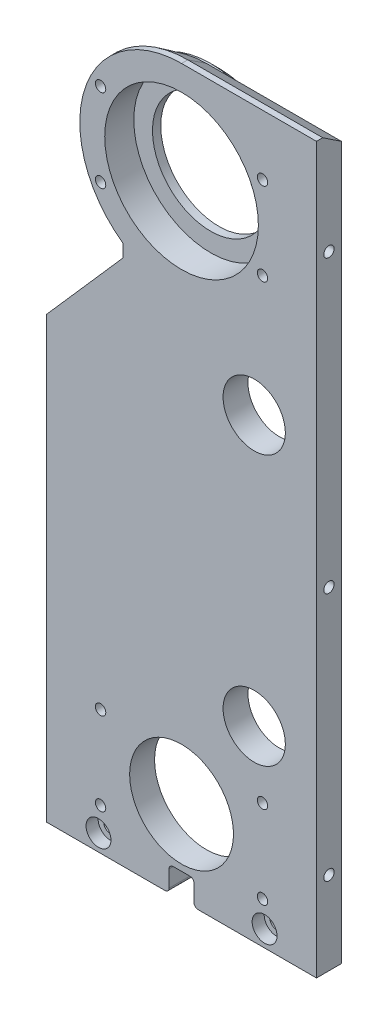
ISO-10303-21;
HEADER;
FILE_DESCRIPTION(('STEP AP214'),'2;1');
FILE_NAME('part.step','',(''),(''),'','','');
FILE_SCHEMA(('AUTOMOTIVE_DESIGN { 1 0 10303 214 1 1 1 1 }'));
ENDSEC;
DATA;
#1=APPLICATION_CONTEXT('core data for automotive mechanical design processes');
#2=APPLICATION_PROTOCOL_DEFINITION('international standard','automotive_design',2000,#1);
#3=PRODUCT_CONTEXT('',#1,'mechanical');
#4=PRODUCT('Part','Part','',(#3));
#5=PRODUCT_RELATED_PRODUCT_CATEGORY('part','',(#4));
#6=PRODUCT_DEFINITION_FORMATION('','',#4);
#7=PRODUCT_DEFINITION_CONTEXT('part definition',#1,'design');
#8=PRODUCT_DEFINITION('design','',#6,#7);
#9=PRODUCT_DEFINITION_SHAPE('','',#8);
#10=(LENGTH_UNIT() NAMED_UNIT(*) SI_UNIT(.MILLI.,.METRE.));
#11=(NAMED_UNIT(*) PLANE_ANGLE_UNIT() SI_UNIT($,.RADIAN.));
#12=(NAMED_UNIT(*) SI_UNIT($,.STERADIAN.) SOLID_ANGLE_UNIT());
#13=UNCERTAINTY_MEASURE_WITH_UNIT(LENGTH_MEASURE(1.E-05),#10,'distance_accuracy_value','');
#14=(GEOMETRIC_REPRESENTATION_CONTEXT(3) GLOBAL_UNCERTAINTY_ASSIGNED_CONTEXT((#13)) GLOBAL_UNIT_ASSIGNED_CONTEXT((#10,
#11,#12)) REPRESENTATION_CONTEXT('',''));
#15=CARTESIAN_POINT('',(0.,0.,0.));
#16=DIRECTION('',(0.,0.,1.));
#17=DIRECTION('',(1.,0.,0.));
#18=AXIS2_PLACEMENT_3D('',#15,#16,#17);
#19=CARTESIAN_POINT('',(-32.5,-150.,3.));
#20=DIRECTION('',(0.,1.,0.));
#21=DIRECTION('',(0.,0.,1.));
#22=AXIS2_PLACEMENT_3D('',#19,#20,#21);
#23=PLANE('',#22);
#24=DIRECTION('',(1.,0.,0.));
#25=VECTOR('',#24,1.);
#26=CARTESIAN_POINT('',(-32.5,-150.,3.));
#27=LINE('',#26,#25);
#28=CARTESIAN_POINT('',(4.,-150.,3.));
#29=VERTEX_POINT('',#28);
#30=CARTESIAN_POINT('',(32.5,-150.,3.));
#31=VERTEX_POINT('',#30);
#32=EDGE_CURVE('E430',#29,#31,#27,.T.);
#33=ORIENTED_EDGE('',*,*,#32,.F.);
#34=DIRECTION('',(0.,0.,-1.));
#35=VECTOR('',#34,1.);
#36=CARTESIAN_POINT('',(4.,-150.,3.));
#37=LINE('',#36,#35);
#38=CARTESIAN_POINT('',(4.,-150.,-3.));
#39=VERTEX_POINT('',#38);
#40=EDGE_CURVE('E730',#29,#39,#37,.T.);
#41=ORIENTED_EDGE('',*,*,#40,.T.);
#42=DIRECTION('',(1.,0.,0.));
#43=VECTOR('',#42,1.);
#44=CARTESIAN_POINT('',(-32.5,-150.,-3.));
#45=LINE('',#44,#43);
#46=CARTESIAN_POINT('',(32.5,-150.,-3.));
#47=VERTEX_POINT('',#46);
#48=EDGE_CURVE('E439',#39,#47,#45,.T.);
#49=ORIENTED_EDGE('',*,*,#48,.T.);
#50=DIRECTION('',(0.,0.,-1.));
#51=VECTOR('',#50,1.);
#52=CARTESIAN_POINT('',(32.5,-150.,3.));
#53=LINE('',#52,#51);
#54=EDGE_CURVE('E434',#31,#47,#53,.T.);
#55=ORIENTED_EDGE('',*,*,#54,.F.);
#56=EDGE_LOOP('',(#33,#41,#49,#55));
#57=FACE_BOUND('',#56,.T.);
#58=ADVANCED_FACE('F39',(#57),#23,.F.);
#59=CARTESIAN_POINT('',(20.,-146.,-6.));
#60=DIRECTION('',(0.,0.,1.));
#61=DIRECTION('',(1.,0.,0.));
#62=AXIS2_PLACEMENT_3D('',#59,#60,#61);
#63=CYLINDRICAL_SURFACE('',#62,1.65000000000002);
#64=CARTESIAN_POINT('',(20.,-146.,-3.));
#65=DIRECTION('',(0.,0.,-1.));
#66=DIRECTION('',(-1.,0.,0.));
#67=AXIS2_PLACEMENT_3D('',#64,#65,#66);
#68=CIRCLE('',#67,1.65000000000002);
#69=CARTESIAN_POINT('',(18.35,-146.,-3.));
#70=VERTEX_POINT('',#69);
#71=EDGE_CURVE('E309',#70,#70,#68,.T.);
#72=ORIENTED_EDGE('',*,*,#71,.T.);
#73=EDGE_LOOP('',(#72));
#74=FACE_BOUND('',#73,.T.);
#75=CARTESIAN_POINT('',(20.,-146.,0.1));
#76=DIRECTION('',(0.,0.,1.));
#77=DIRECTION('',(1.,0.,0.));
#78=AXIS2_PLACEMENT_3D('',#75,#76,#77);
#79=CIRCLE('',#78,1.65000000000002);
#80=CARTESIAN_POINT('',(21.65,-146.,0.1));
#81=VERTEX_POINT('',#80);
#82=EDGE_CURVE('E294',#81,#81,#79,.T.);
#83=ORIENTED_EDGE('',*,*,#82,.T.);
#84=EDGE_LOOP('',(#83));
#85=FACE_BOUND('',#84,.T.);
#86=ADVANCED_FACE('F763',(#74,#85),#63,.F.);
#87=CARTESIAN_POINT('',(-20.,-146.,-6.));
#88=DIRECTION('',(0.,0.,1.));
#89=DIRECTION('',(1.,0.,0.));
#90=AXIS2_PLACEMENT_3D('',#87,#88,#89);
#91=CYLINDRICAL_SURFACE('',#90,1.65000000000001);
#92=CARTESIAN_POINT('',(-20.,-146.,-3.));
#93=DIRECTION('',(0.,0.,-1.));
#94=DIRECTION('',(-1.,0.,0.));
#95=AXIS2_PLACEMENT_3D('',#92,#93,#94);
#96=CIRCLE('',#95,1.65000000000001);
#97=CARTESIAN_POINT('',(-21.65,-146.,-3.));
#98=VERTEX_POINT('',#97);
#99=EDGE_CURVE('E314',#98,#98,#96,.T.);
#100=ORIENTED_EDGE('',*,*,#99,.T.);
#101=EDGE_LOOP('',(#100));
#102=FACE_BOUND('',#101,.T.);
#103=CARTESIAN_POINT('',(-20.,-146.,0.1));
#104=DIRECTION('',(0.,0.,1.));
#105=DIRECTION('',(1.,0.,0.));
#106=AXIS2_PLACEMENT_3D('',#103,#104,#105);
#107=CIRCLE('',#106,1.65000000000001);
#108=CARTESIAN_POINT('',(-18.35,-146.,0.1));
#109=VERTEX_POINT('',#108);
#110=EDGE_CURVE('E303',#109,#109,#107,.T.);
#111=ORIENTED_EDGE('',*,*,#110,.T.);
#112=EDGE_LOOP('',(#111));
#113=FACE_BOUND('',#112,.T.);
#114=ADVANCED_FACE('F529',(#102,#113),#91,.F.);
#115=CARTESIAN_POINT('',(0.,0.,-3.));
#116=DIRECTION('',(0.,0.,-1.));
#117=DIRECTION('',(-1.,0.,0.));
#118=AXIS2_PLACEMENT_3D('',#115,#116,#117);
#119=PLANE('',#118);
#120=CARTESIAN_POINT('',(-19.5,-10.,-3.));
#121=DIRECTION('',(0.,0.,-1.));
#122=DIRECTION('',(-1.,0.,0.));
#123=AXIS2_PLACEMENT_3D('',#120,#121,#122);
#124=CIRCLE('',#123,1.24999999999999);
#125=CARTESIAN_POINT('',(-19.6356380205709,-8.75738085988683,-3.));
#126=VERTEX_POINT('',#125);
#127=CARTESIAN_POINT('',(-19.0519585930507,-8.83305574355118,-3.));
#128=VERTEX_POINT('',#127);
#129=EDGE_CURVE('E402',#126,#128,#124,.T.);
#130=ORIENTED_EDGE('',*,*,#129,.F.);
#131=CARTESIAN_POINT('',(0.,0.,-3.));
#132=DIRECTION('',(0.,0.,-1.));
#133=DIRECTION('',(-1.,0.,0.));
#134=AXIS2_PLACEMENT_3D('',#131,#132,#133);
#135=CIRCLE('',#134,21.5);
#136=CARTESIAN_POINT('',(-19.6356380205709,8.75738085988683,-3.));
#137=VERTEX_POINT('',#136);
#138=EDGE_CURVE('E598',#126,#137,#135,.T.);
#139=ORIENTED_EDGE('',*,*,#138,.T.);
#140=CARTESIAN_POINT('',(-19.5,10.,-3.));
#141=DIRECTION('',(0.,0.,-1.));
#142=DIRECTION('',(-1.,0.,0.));
#143=AXIS2_PLACEMENT_3D('',#140,#141,#142);
#144=CIRCLE('',#143,1.24999999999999);
#145=CARTESIAN_POINT('',(-19.0519585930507,8.83305574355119,-3.));
#146=VERTEX_POINT('',#145);
#147=EDGE_CURVE('E368',#146,#137,#144,.T.);
#148=ORIENTED_EDGE('',*,*,#147,.F.);
#149=CARTESIAN_POINT('',(0.,0.,-3.));
#150=DIRECTION('',(0.,0.,-1.));
#151=DIRECTION('',(-1.,0.,0.));
#152=AXIS2_PLACEMENT_3D('',#149,#150,#151);
#153=CIRCLE('',#152,21.);
#154=EDGE_CURVE('E416',#128,#146,#153,.T.);
#155=ORIENTED_EDGE('',*,*,#154,.F.);
#156=EDGE_LOOP('',(#130,#139,#148,#155));
#157=FACE_BOUND('',#156,.T.);
#158=ADVANCED_FACE('F647',(#157),#119,.T.);
#159=CARTESIAN_POINT('',(17.5,-105.,-3.));
#160=DIRECTION('',(0.,0.,-1.));
#161=DIRECTION('',(-1.,0.,0.));
#162=AXIS2_PLACEMENT_3D('',#159,#160,#161);
#163=CIRCLE('',#162,7.5);
#164=CARTESIAN_POINT('',(10.,-105.,-3.));
#165=VERTEX_POINT('',#164);
#166=EDGE_CURVE('E1121',#165,#165,#163,.T.);
#167=ORIENTED_EDGE('',*,*,#166,.F.);
#168=EDGE_LOOP('',(#167));
#169=FACE_BOUND('',#168,.T.);
#170=CARTESIAN_POINT('',(17.5,-40.0706568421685,-3.));
#171=DIRECTION('',(0.,0.,-1.));
#172=DIRECTION('',(-1.,0.,0.));
#173=AXIS2_PLACEMENT_3D('',#170,#171,#172);
#174=CIRCLE('',#173,7.5);
#175=CARTESIAN_POINT('',(10.,-40.0706568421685,-3.));
#176=VERTEX_POINT('',#175);
#177=EDGE_CURVE('E252',#176,#176,#174,.T.);
#178=ORIENTED_EDGE('',*,*,#177,.F.);
#179=EDGE_LOOP('',(#178));
#180=FACE_BOUND('',#179,.T.);
#181=DIRECTION('',(0.,1.,0.));
#182=VECTOR('',#181,1.);
#183=CARTESIAN_POINT('',(-3.00000000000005,0.,-3.));
#184=LINE('',#183,#182);
#185=CARTESIAN_POINT('',(-3.,-149.,-3.));
#186=VERTEX_POINT('',#185);
#187=CARTESIAN_POINT('',(-3.,-145.,-3.));
#188=VERTEX_POINT('',#187);
#189=EDGE_CURVE('E285',#186,#188,#184,.T.);
#190=ORIENTED_EDGE('',*,*,#189,.F.);
#191=CARTESIAN_POINT('',(-3.99999999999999,-149.,-3.));
#192=DIRECTION('',(0.,0.,-1.));
#193=DIRECTION('',(-1.,0.,0.));
#194=AXIS2_PLACEMENT_3D('',#191,#192,#193);
#195=CIRCLE('',#194,1.);
#196=CARTESIAN_POINT('',(-3.99999999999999,-150.,-3.));
#197=VERTEX_POINT('',#196);
#198=EDGE_CURVE('E719',#186,#197,#195,.T.);
#199=ORIENTED_EDGE('',*,*,#198,.T.);
#200=CARTESIAN_POINT('',(-32.5,-150.,-3.));
#201=VERTEX_POINT('',#200);
#202=EDGE_CURVE('E428',#201,#197,#45,.T.);
#203=ORIENTED_EDGE('',*,*,#202,.F.);
#204=DIRECTION('',(0.,-1.,0.));
#205=VECTOR('',#204,1.);
#206=CARTESIAN_POINT('',(-32.5,-150.,-3.));
#207=LINE('',#206,#205);
#208=CARTESIAN_POINT('',(-32.5,-48.6148869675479,-3.));
#209=VERTEX_POINT('',#208);
#210=EDGE_CURVE('E437',#209,#201,#207,.T.);
#211=ORIENTED_EDGE('',*,*,#210,.F.);
#212=DIRECTION('',(0.659969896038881,0.751292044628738,0.));
#213=VECTOR('',#212,1.);
#214=CARTESIAN_POINT('',(5.76043442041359,-5.06023367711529,-3.));
#215=LINE('',#214,#213);
#216=CARTESIAN_POINT('',(-14.0526226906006,-27.6148869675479,-3.));
#217=VERTEX_POINT('',#216);
#218=EDGE_CURVE('E518',#209,#217,#215,.T.);
#219=ORIENTED_EDGE('',*,*,#218,.T.);
#220=DIRECTION('',(0.,1.,0.));
#221=VECTOR('',#220,1.);
#222=CARTESIAN_POINT('',(-14.0526226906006,0.,-3.));
#223=LINE('',#222,#221);
#224=CARTESIAN_POINT('',(-14.0526226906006,-16.2718712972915,-3.));
#225=VERTEX_POINT('',#224);
#226=EDGE_CURVE('E332',#217,#225,#223,.T.);
#227=ORIENTED_EDGE('',*,*,#226,.T.);
#228=CARTESIAN_POINT('',(0.,0.,-3.));
#229=DIRECTION('',(0.,0.,-1.));
#230=DIRECTION('',(-1.,0.,0.));
#231=AXIS2_PLACEMENT_3D('',#228,#229,#230);
#232=CIRCLE('',#231,21.5);
#233=CARTESIAN_POINT('',(-18.5700491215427,-10.8352792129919,-3.));
#234=VERTEX_POINT('',#233);
#235=EDGE_CURVE('E593',#225,#234,#232,.T.);
#236=ORIENTED_EDGE('',*,*,#235,.T.);
#237=CARTESIAN_POINT('',(-18.2908966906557,-10.3171264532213,-3.));
#238=VERTEX_POINT('',#237);
#239=EDGE_CURVE('E403',#238,#234,#124,.T.);
#240=ORIENTED_EDGE('',*,*,#239,.F.);
#241=CARTESIAN_POINT('',(18.2908966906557,-10.3171264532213,-3.));
#242=VERTEX_POINT('',#241);
#243=EDGE_CURVE('E415',#242,#238,#153,.T.);
#244=ORIENTED_EDGE('',*,*,#243,.F.);
#245=CARTESIAN_POINT('',(19.5,-10.,-3.));
#246=DIRECTION('',(0.,0.,-1.));
#247=DIRECTION('',(-1.,0.,0.));
#248=AXIS2_PLACEMENT_3D('',#245,#246,#247);
#249=CIRCLE('',#248,1.24999999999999);
#250=CARTESIAN_POINT('',(19.0519585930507,-8.8330557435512,-3.));
#251=VERTEX_POINT('',#250);
#252=EDGE_CURVE('E391',#251,#242,#249,.T.);
#253=ORIENTED_EDGE('',*,*,#252,.F.);
#254=CARTESIAN_POINT('',(19.0519585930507,8.83305574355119,-3.));
#255=VERTEX_POINT('',#254);
#256=EDGE_CURVE('E631',#255,#251,#153,.T.);
#257=ORIENTED_EDGE('',*,*,#256,.F.);
#258=CARTESIAN_POINT('',(19.5,10.,-3.));
#259=DIRECTION('',(0.,0.,-1.));
#260=DIRECTION('',(-1.,0.,0.));
#261=AXIS2_PLACEMENT_3D('',#258,#259,#260);
#262=CIRCLE('',#261,1.24999999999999);
#263=CARTESIAN_POINT('',(18.2908966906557,10.3171264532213,-3.));
#264=VERTEX_POINT('',#263);
#265=EDGE_CURVE('E380',#264,#255,#262,.T.);
#266=ORIENTED_EDGE('',*,*,#265,.F.);
#267=CARTESIAN_POINT('',(-18.2908966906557,10.3171264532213,-3.));
#268=VERTEX_POINT('',#267);
#269=EDGE_CURVE('E420',#268,#264,#153,.T.);
#270=ORIENTED_EDGE('',*,*,#269,.F.);
#271=CARTESIAN_POINT('',(-18.5700491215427,10.8352792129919,-3.));
#272=VERTEX_POINT('',#271);
#273=EDGE_CURVE('E367',#272,#268,#144,.T.);
#274=ORIENTED_EDGE('',*,*,#273,.F.);
#275=CARTESIAN_POINT('',(0.,0.,-3.));
#276=DIRECTION('',(0.,0.,-1.));
#277=DIRECTION('',(-1.,0.,0.));
#278=AXIS2_PLACEMENT_3D('',#275,#276,#277);
#279=CIRCLE('',#278,21.5);
#280=CARTESIAN_POINT('',(0.,21.5,-3.));
#281=VERTEX_POINT('',#280);
#282=EDGE_CURVE('E595',#272,#281,#279,.T.);
#283=ORIENTED_EDGE('',*,*,#282,.T.);
#284=DIRECTION('',(1.,0.,0.));
#285=VECTOR('',#284,1.);
#286=CARTESIAN_POINT('',(32.5,21.5,-3.));
#287=LINE('',#286,#285);
#288=CARTESIAN_POINT('',(32.5,21.5,-3.));
#289=VERTEX_POINT('',#288);
#290=EDGE_CURVE('E597',#281,#289,#287,.T.);
#291=ORIENTED_EDGE('',*,*,#290,.T.);
#292=DIRECTION('',(0.,1.,0.));
#293=VECTOR('',#292,1.);
#294=CARTESIAN_POINT('',(32.5,-150.,-3.));
#295=LINE('',#294,#293);
#296=EDGE_CURVE('E423',#47,#289,#295,.T.);
#297=ORIENTED_EDGE('',*,*,#296,.F.);
#298=ORIENTED_EDGE('',*,*,#48,.F.);
#299=CARTESIAN_POINT('',(4.,-149.,-3.));
#300=DIRECTION('',(0.,0.,-1.));
#301=DIRECTION('',(-1.,0.,0.));
#302=AXIS2_PLACEMENT_3D('',#299,#300,#301);
#303=CIRCLE('',#302,1.);
#304=CARTESIAN_POINT('',(3.,-149.,-3.));
#305=VERTEX_POINT('',#304);
#306=EDGE_CURVE('E54',#39,#305,#303,.T.);
#307=ORIENTED_EDGE('',*,*,#306,.T.);
#308=DIRECTION('',(0.,-1.,0.));
#309=VECTOR('',#308,1.);
#310=CARTESIAN_POINT('',(2.99999999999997,0.,-3.));
#311=LINE('',#310,#309);
#312=CARTESIAN_POINT('',(3.,-145.,-3.));
#313=VERTEX_POINT('',#312);
#314=EDGE_CURVE('E288',#313,#305,#311,.T.);
#315=ORIENTED_EDGE('',*,*,#314,.F.);
#316=CARTESIAN_POINT('',(2.,-145.,-3.));
#317=DIRECTION('',(0.,0.,-1.));
#318=DIRECTION('',(-1.,0.,0.));
#319=AXIS2_PLACEMENT_3D('',#316,#317,#318);
#320=CIRCLE('',#319,1.);
#321=CARTESIAN_POINT('',(2.,-144.,-3.));
#322=VERTEX_POINT('',#321);
#323=EDGE_CURVE('E11',#313,#322,#320,.F.);
#324=ORIENTED_EDGE('',*,*,#323,.T.);
#325=DIRECTION('',(1.,0.,0.));
#326=VECTOR('',#325,1.);
#327=CARTESIAN_POINT('',(0.,-144.,-3.));
#328=LINE('',#327,#326);
#329=CARTESIAN_POINT('',(-2.,-144.,-3.));
#330=VERTEX_POINT('',#329);
#331=EDGE_CURVE('E291',#330,#322,#328,.T.);
#332=ORIENTED_EDGE('',*,*,#331,.F.);
#333=CARTESIAN_POINT('',(-2.,-145.,-3.));
#334=DIRECTION('',(0.,0.,-1.));
#335=DIRECTION('',(-1.,0.,0.));
#336=AXIS2_PLACEMENT_3D('',#333,#334,#335);
#337=CIRCLE('',#336,1.);
#338=EDGE_CURVE('E734',#330,#188,#337,.F.);
#339=ORIENTED_EDGE('',*,*,#338,.T.);
#340=EDGE_LOOP('',(#190,#199,#203,#211,#219,#227,#236,#240,#244,#253,#257,#266,#270,#274,#283,
#291,#297,#298,#307,#315,#324,#332,#339));
#341=FACE_BOUND('',#340,.T.);
#342=ORIENTED_EDGE('',*,*,#71,.F.);
#343=EDGE_LOOP('',(#342));
#344=FACE_BOUND('',#343,.T.);
#345=ORIENTED_EDGE('',*,*,#99,.F.);
#346=EDGE_LOOP('',(#345));
#347=FACE_BOUND('',#346,.T.);
#348=CARTESIAN_POINT('',(0.,-130.,-3.));
#349=DIRECTION('',(0.,0.,-1.));
#350=DIRECTION('',(-1.,0.,0.));
#351=AXIS2_PLACEMENT_3D('',#348,#349,#350);
#352=CIRCLE('',#351,12.5);
#353=CARTESIAN_POINT('',(-12.5,-130.,-3.));
#354=VERTEX_POINT('',#353);
#355=EDGE_CURVE('E335',#354,#354,#352,.T.);
#356=ORIENTED_EDGE('',*,*,#355,.F.);
#357=EDGE_LOOP('',(#356));
#358=FACE_BOUND('',#357,.T.);
#359=CARTESIAN_POINT('',(-19.5,-120.,-3.));
#360=DIRECTION('',(0.,0.,-1.));
#361=DIRECTION('',(-1.,0.,0.));
#362=AXIS2_PLACEMENT_3D('',#359,#360,#361);
#363=CIRCLE('',#362,1.24999999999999);
#364=CARTESIAN_POINT('',(-20.75,-120.,-3.));
#365=VERTEX_POINT('',#364);
#366=EDGE_CURVE('E341',#365,#365,#363,.T.);
#367=ORIENTED_EDGE('',*,*,#366,.F.);
#368=EDGE_LOOP('',(#367));
#369=FACE_BOUND('',#368,.T.);
#370=CARTESIAN_POINT('',(19.5,-120.,-3.));
#371=DIRECTION('',(0.,0.,-1.));
#372=DIRECTION('',(-1.,0.,0.));
#373=AXIS2_PLACEMENT_3D('',#370,#371,#372);
#374=CIRCLE('',#373,1.24999999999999);
#375=CARTESIAN_POINT('',(18.25,-120.,-3.));
#376=VERTEX_POINT('',#375);
#377=EDGE_CURVE('E345',#376,#376,#374,.T.);
#378=ORIENTED_EDGE('',*,*,#377,.F.);
#379=EDGE_LOOP('',(#378));
#380=FACE_BOUND('',#379,.T.);
#381=CARTESIAN_POINT('',(-19.5,-140.,-3.));
#382=DIRECTION('',(0.,0.,-1.));
#383=DIRECTION('',(-1.,0.,0.));
#384=AXIS2_PLACEMENT_3D('',#381,#382,#383);
#385=CIRCLE('',#384,1.24999999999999);
#386=CARTESIAN_POINT('',(-20.75,-140.,-3.));
#387=VERTEX_POINT('',#386);
#388=EDGE_CURVE('E351',#387,#387,#385,.T.);
#389=ORIENTED_EDGE('',*,*,#388,.F.);
#390=EDGE_LOOP('',(#389));
#391=FACE_BOUND('',#390,.T.);
#392=CARTESIAN_POINT('',(19.5,-140.,-3.));
#393=DIRECTION('',(0.,0.,-1.));
#394=DIRECTION('',(-1.,0.,0.));
#395=AXIS2_PLACEMENT_3D('',#392,#393,#394);
#396=CIRCLE('',#395,1.24999999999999);
#397=CARTESIAN_POINT('',(18.25,-140.,-3.));
#398=VERTEX_POINT('',#397);
#399=EDGE_CURVE('E355',#398,#398,#396,.T.);
#400=ORIENTED_EDGE('',*,*,#399,.F.);
#401=EDGE_LOOP('',(#400));
#402=FACE_BOUND('',#401,.T.);
#403=ADVANCED_FACE('F625',(#169,#180,#341,#344,#347,#358,#369,#380,#391,#402),#119,.T.);
#404=CARTESIAN_POINT('',(0.,0.,3.));
#405=DIRECTION('',(0.,0.,-1.));
#406=DIRECTION('',(-1.,0.,0.));
#407=AXIS2_PLACEMENT_3D('',#404,#405,#406);
#408=PLANE('',#407);
#409=CARTESIAN_POINT('',(17.5,-105.,3.));
#410=DIRECTION('',(0.,0.,1.));
#411=DIRECTION('',(1.,0.,0.));
#412=AXIS2_PLACEMENT_3D('',#409,#410,#411);
#413=CIRCLE('',#412,7.5);
#414=CARTESIAN_POINT('',(25.,-105.,3.));
#415=VERTEX_POINT('',#414);
#416=EDGE_CURVE('E1130',#415,#415,#413,.T.);
#417=ORIENTED_EDGE('',*,*,#416,.F.);
#418=EDGE_LOOP('',(#417));
#419=FACE_BOUND('',#418,.T.);
#420=CARTESIAN_POINT('',(17.5,-40.0706568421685,3.));
#421=DIRECTION('',(0.,0.,1.));
#422=DIRECTION('',(1.,0.,0.));
#423=AXIS2_PLACEMENT_3D('',#420,#421,#422);
#424=CIRCLE('',#423,7.5);
#425=CARTESIAN_POINT('',(25.,-40.0706568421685,3.));
#426=VERTEX_POINT('',#425);
#427=EDGE_CURVE('E1125',#426,#426,#424,.T.);
#428=ORIENTED_EDGE('',*,*,#427,.F.);
#429=EDGE_LOOP('',(#428));
#430=FACE_BOUND('',#429,.T.);
#431=CARTESIAN_POINT('',(20.,-146.,3.));
#432=DIRECTION('',(0.,0.,1.));
#433=DIRECTION('',(1.,0.,0.));
#434=AXIS2_PLACEMENT_3D('',#431,#432,#433);
#435=CIRCLE('',#434,3.);
#436=CARTESIAN_POINT('',(23.,-146.,3.));
#437=VERTEX_POINT('',#436);
#438=EDGE_CURVE('E293',#437,#437,#435,.T.);
#439=ORIENTED_EDGE('',*,*,#438,.F.);
#440=EDGE_LOOP('',(#439));
#441=FACE_BOUND('',#440,.T.);
#442=CARTESIAN_POINT('',(-20.,-146.,3.));
#443=DIRECTION('',(0.,0.,1.));
#444=DIRECTION('',(1.,0.,0.));
#445=AXIS2_PLACEMENT_3D('',#442,#443,#444);
#446=CIRCLE('',#445,3.);
#447=CARTESIAN_POINT('',(-17.,-146.,3.));
#448=VERTEX_POINT('',#447);
#449=EDGE_CURVE('E300',#448,#448,#446,.T.);
#450=ORIENTED_EDGE('',*,*,#449,.F.);
#451=EDGE_LOOP('',(#450));
#452=FACE_BOUND('',#451,.T.);
#453=CARTESIAN_POINT('',(0.,0.,3.));
#454=DIRECTION('',(0.,0.,1.));
#455=DIRECTION('',(1.,0.,0.));
#456=AXIS2_PLACEMENT_3D('',#453,#454,#455);
#457=CIRCLE('',#456,18.5);
#458=CARTESIAN_POINT('',(18.5,0.,3.));
#459=VERTEX_POINT('',#458);
#460=EDGE_CURVE('E419',#459,#459,#457,.T.);
#461=ORIENTED_EDGE('',*,*,#460,.F.);
#462=EDGE_LOOP('',(#461));
#463=FACE_BOUND('',#462,.T.);
#464=CARTESIAN_POINT('',(-19.5,-10.,3.));
#465=DIRECTION('',(0.,0.,1.));
#466=DIRECTION('',(1.,0.,0.));
#467=AXIS2_PLACEMENT_3D('',#464,#465,#466);
#468=CIRCLE('',#467,1.24999999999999);
#469=CARTESIAN_POINT('',(-18.25,-10.,3.));
#470=VERTEX_POINT('',#469);
#471=EDGE_CURVE('E393',#470,#470,#468,.T.);
#472=ORIENTED_EDGE('',*,*,#471,.F.);
#473=EDGE_LOOP('',(#472));
#474=FACE_BOUND('',#473,.T.);
#475=CARTESIAN_POINT('',(19.5,-10.,3.));
#476=DIRECTION('',(0.,0.,1.));
#477=DIRECTION('',(1.,0.,0.));
#478=AXIS2_PLACEMENT_3D('',#475,#476,#477);
#479=CIRCLE('',#478,1.24999999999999);
#480=CARTESIAN_POINT('',(20.75,-10.,3.));
#481=VERTEX_POINT('',#480);
#482=EDGE_CURVE('E382',#481,#481,#479,.T.);
#483=ORIENTED_EDGE('',*,*,#482,.F.);
#484=EDGE_LOOP('',(#483));
#485=FACE_BOUND('',#484,.T.);
#486=CARTESIAN_POINT('',(19.5,10.,3.));
#487=DIRECTION('',(0.,0.,1.));
#488=DIRECTION('',(1.,0.,0.));
#489=AXIS2_PLACEMENT_3D('',#486,#487,#488);
#490=CIRCLE('',#489,1.24999999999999);
#491=CARTESIAN_POINT('',(20.75,10.,3.));
#492=VERTEX_POINT('',#491);
#493=EDGE_CURVE('E371',#492,#492,#490,.T.);
#494=ORIENTED_EDGE('',*,*,#493,.F.);
#495=EDGE_LOOP('',(#494));
#496=FACE_BOUND('',#495,.T.);
#497=CARTESIAN_POINT('',(-19.5,10.,3.));
#498=DIRECTION('',(0.,0.,1.));
#499=DIRECTION('',(1.,0.,0.));
#500=AXIS2_PLACEMENT_3D('',#497,#498,#499);
#501=CIRCLE('',#500,1.24999999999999);
#502=CARTESIAN_POINT('',(-18.25,10.,3.));
#503=VERTEX_POINT('',#502);
#504=EDGE_CURVE('E358',#503,#503,#501,.T.);
#505=ORIENTED_EDGE('',*,*,#504,.F.);
#506=EDGE_LOOP('',(#505));
#507=FACE_BOUND('',#506,.T.);
#508=CARTESIAN_POINT('',(19.5,-140.,3.));
#509=DIRECTION('',(0.,0.,1.));
#510=DIRECTION('',(1.,0.,0.));
#511=AXIS2_PLACEMENT_3D('',#508,#509,#510);
#512=CIRCLE('',#511,1.24999999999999);
#513=CARTESIAN_POINT('',(20.75,-140.,3.));
#514=VERTEX_POINT('',#513);
#515=EDGE_CURVE('E352',#514,#514,#512,.T.);
#516=ORIENTED_EDGE('',*,*,#515,.F.);
#517=EDGE_LOOP('',(#516));
#518=FACE_BOUND('',#517,.T.);
#519=CARTESIAN_POINT('',(-19.5,-140.,3.));
#520=DIRECTION('',(0.,0.,1.));
#521=DIRECTION('',(1.,0.,0.));
#522=AXIS2_PLACEMENT_3D('',#519,#520,#521);
#523=CIRCLE('',#522,1.24999999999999);
#524=CARTESIAN_POINT('',(-18.25,-140.,3.));
#525=VERTEX_POINT('',#524);
#526=EDGE_CURVE('E348',#525,#525,#523,.T.);
#527=ORIENTED_EDGE('',*,*,#526,.F.);
#528=EDGE_LOOP('',(#527));
#529=FACE_BOUND('',#528,.T.);
#530=CARTESIAN_POINT('',(19.5,-120.,3.));
#531=DIRECTION('',(0.,0.,1.));
#532=DIRECTION('',(1.,0.,0.));
#533=AXIS2_PLACEMENT_3D('',#530,#531,#532);
#534=CIRCLE('',#533,1.24999999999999);
#535=CARTESIAN_POINT('',(20.75,-120.,3.));
#536=VERTEX_POINT('',#535);
#537=EDGE_CURVE('E342',#536,#536,#534,.T.);
#538=ORIENTED_EDGE('',*,*,#537,.F.);
#539=EDGE_LOOP('',(#538));
#540=FACE_BOUND('',#539,.T.);
#541=CARTESIAN_POINT('',(-19.5,-120.,3.));
#542=DIRECTION('',(0.,0.,1.));
#543=DIRECTION('',(1.,0.,0.));
#544=AXIS2_PLACEMENT_3D('',#541,#542,#543);
#545=CIRCLE('',#544,1.24999999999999);
#546=CARTESIAN_POINT('',(-18.25,-120.,3.));
#547=VERTEX_POINT('',#546);
#548=EDGE_CURVE('E338',#547,#547,#545,.T.);
#549=ORIENTED_EDGE('',*,*,#548,.F.);
#550=EDGE_LOOP('',(#549));
#551=FACE_BOUND('',#550,.T.);
#552=CARTESIAN_POINT('',(0.,-130.,3.));
#553=DIRECTION('',(0.,0.,-1.));
#554=DIRECTION('',(-1.,0.,0.));
#555=AXIS2_PLACEMENT_3D('',#552,#553,#554);
#556=CIRCLE('',#555,12.5);
#557=CARTESIAN_POINT('',(-12.5,-130.,3.));
#558=VERTEX_POINT('',#557);
#559=EDGE_CURVE('E334',#558,#558,#556,.T.);
#560=ORIENTED_EDGE('',*,*,#559,.T.);
#561=EDGE_LOOP('',(#560));
#562=FACE_BOUND('',#561,.T.);
#563=CARTESIAN_POINT('',(-32.5,-150.,3.));
#564=VERTEX_POINT('',#563);
#565=CARTESIAN_POINT('',(-3.99999999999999,-150.,3.));
#566=VERTEX_POINT('',#565);
#567=EDGE_CURVE('E431',#564,#566,#27,.T.);
#568=ORIENTED_EDGE('',*,*,#567,.T.);
#569=CARTESIAN_POINT('',(-3.99999999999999,-149.,3.));
#570=DIRECTION('',(0.,0.,-1.));
#571=DIRECTION('',(-1.,0.,0.));
#572=AXIS2_PLACEMENT_3D('',#569,#570,#571);
#573=CIRCLE('',#572,1.);
#574=CARTESIAN_POINT('',(-3.,-149.,3.));
#575=VERTEX_POINT('',#574);
#576=EDGE_CURVE('E692',#566,#575,#573,.F.);
#577=ORIENTED_EDGE('',*,*,#576,.T.);
#578=DIRECTION('',(0.,-1.,0.));
#579=VECTOR('',#578,1.);
#580=CARTESIAN_POINT('',(-3.,-144.,3.));
#581=LINE('',#580,#579);
#582=CARTESIAN_POINT('',(-3.,-145.,3.));
#583=VERTEX_POINT('',#582);
#584=EDGE_CURVE('E282',#583,#575,#581,.T.);
#585=ORIENTED_EDGE('',*,*,#584,.F.);
#586=CARTESIAN_POINT('',(-2.,-145.,3.));
#587=DIRECTION('',(0.,0.,-1.));
#588=DIRECTION('',(-1.,0.,0.));
#589=AXIS2_PLACEMENT_3D('',#586,#587,#588);
#590=CIRCLE('',#589,1.);
#591=CARTESIAN_POINT('',(-2.,-144.,3.));
#592=VERTEX_POINT('',#591);
#593=EDGE_CURVE('E732',#583,#592,#590,.T.);
#594=ORIENTED_EDGE('',*,*,#593,.T.);
#595=DIRECTION('',(-1.,0.,0.));
#596=VECTOR('',#595,1.);
#597=CARTESIAN_POINT('',(-3.,-144.,3.));
#598=LINE('',#597,#596);
#599=CARTESIAN_POINT('',(2.,-144.,3.));
#600=VERTEX_POINT('',#599);
#601=EDGE_CURVE('E279',#600,#592,#598,.T.);
#602=ORIENTED_EDGE('',*,*,#601,.F.);
#603=CARTESIAN_POINT('',(2.,-145.,3.));
#604=DIRECTION('',(0.,0.,-1.));
#605=DIRECTION('',(-1.,0.,0.));
#606=AXIS2_PLACEMENT_3D('',#603,#604,#605);
#607=CIRCLE('',#606,1.);
#608=CARTESIAN_POINT('',(3.,-145.,3.));
#609=VERTEX_POINT('',#608);
#610=EDGE_CURVE('E47',#600,#609,#607,.T.);
#611=ORIENTED_EDGE('',*,*,#610,.T.);
#612=DIRECTION('',(0.,1.,0.));
#613=VECTOR('',#612,1.);
#614=CARTESIAN_POINT('',(3.,-144.,3.));
#615=LINE('',#614,#613);
#616=CARTESIAN_POINT('',(3.,-149.,3.));
#617=VERTEX_POINT('',#616);
#618=EDGE_CURVE('E276',#617,#609,#615,.T.);
#619=ORIENTED_EDGE('',*,*,#618,.F.);
#620=CARTESIAN_POINT('',(4.,-149.,3.));
#621=DIRECTION('',(0.,0.,-1.));
#622=DIRECTION('',(-1.,0.,0.));
#623=AXIS2_PLACEMENT_3D('',#620,#621,#622);
#624=CIRCLE('',#623,1.);
#625=EDGE_CURVE('E704',#617,#29,#624,.F.);
#626=ORIENTED_EDGE('',*,*,#625,.T.);
#627=ORIENTED_EDGE('',*,*,#32,.T.);
#628=DIRECTION('',(0.,1.,0.));
#629=VECTOR('',#628,1.);
#630=CARTESIAN_POINT('',(32.5,-150.,3.));
#631=LINE('',#630,#629);
#632=CARTESIAN_POINT('',(32.5,24.5,3.));
#633=VERTEX_POINT('',#632);
#634=EDGE_CURVE('E424',#31,#633,#631,.T.);
#635=ORIENTED_EDGE('',*,*,#634,.T.);
#636=DIRECTION('',(-1.,0.,0.));
#637=VECTOR('',#636,1.);
#638=CARTESIAN_POINT('',(0.,24.5,3.));
#639=LINE('',#638,#637);
#640=CARTESIAN_POINT('',(0.,24.5,3.));
#641=VERTEX_POINT('',#640);
#642=EDGE_CURVE('E329',#633,#641,#639,.T.);
#643=ORIENTED_EDGE('',*,*,#642,.T.);
#644=CARTESIAN_POINT('',(0.,0.,3.));
#645=DIRECTION('',(0.,0.,1.));
#646=DIRECTION('',(1.,0.,0.));
#647=AXIS2_PLACEMENT_3D('',#644,#645,#646);
#648=CIRCLE('',#647,24.5);
#649=CARTESIAN_POINT('',(-14.0526226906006,-20.0692250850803,3.));
#650=VERTEX_POINT('',#649);
#651=EDGE_CURVE('E584',#650,#641,#648,.F.);
#652=ORIENTED_EDGE('',*,*,#651,.F.);
#653=DIRECTION('',(0.,1.,0.));
#654=VECTOR('',#653,1.);
#655=CARTESIAN_POINT('',(-14.0526226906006,0.,3.));
#656=LINE('',#655,#654);
#657=CARTESIAN_POINT('',(-14.0526226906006,-23.0692250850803,3.));
#658=VERTEX_POINT('',#657);
#659=EDGE_CURVE('E585',#658,#650,#656,.T.);
#660=ORIENTED_EDGE('',*,*,#659,.F.);
#661=DIRECTION('',(0.659969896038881,0.751292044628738,0.));
#662=VECTOR('',#661,1.);
#663=CARTESIAN_POINT('',(3.50655828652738,-3.08032398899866,3.));
#664=LINE('',#663,#662);
#665=CARTESIAN_POINT('',(-32.5,-44.0692250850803,3.));
#666=VERTEX_POINT('',#665);
#667=EDGE_CURVE('E326',#666,#658,#664,.T.);
#668=ORIENTED_EDGE('',*,*,#667,.F.);
#669=DIRECTION('',(0.,-1.,0.));
#670=VECTOR('',#669,1.);
#671=CARTESIAN_POINT('',(-32.5,-150.,3.));
#672=LINE('',#671,#670);
#673=EDGE_CURVE('E427',#666,#564,#672,.T.);
#674=ORIENTED_EDGE('',*,*,#673,.T.);
#675=EDGE_LOOP('',(#568,#577,#585,#594,#602,#611,#619,#626,#627,#635,#643,#652,#660,#668,#674));
#676=FACE_BOUND('',#675,.T.);
#677=ADVANCED_FACE('F670',(#419,#430,#441,#452,#463,#474,#485,#496,#507,#518,#529,#540,#551,
#562,#676),#408,.F.);
#678=CARTESIAN_POINT('',(-32.5,-150.,3.));
#679=DIRECTION('',(1.,0.,0.));
#680=DIRECTION('',(0.,1.,0.));
#681=AXIS2_PLACEMENT_3D('',#678,#679,#680);
#682=PLANE('',#681);
#683=CARTESIAN_POINT('',(-32.5,-130.,0.));
#684=DIRECTION('',(-1.,0.,0.));
#685=DIRECTION('',(0.,0.,1.));
#686=AXIS2_PLACEMENT_3D('',#683,#684,#685);
#687=CIRCLE('',#686,1.25);
#688=CARTESIAN_POINT('',(-32.5,-130.,1.25));
#689=VERTEX_POINT('',#688);
#690=EDGE_CURVE('E264',#689,#689,#687,.T.);
#691=ORIENTED_EDGE('',*,*,#690,.F.);
#692=EDGE_LOOP('',(#691));
#693=FACE_BOUND('',#692,.T.);
#694=CARTESIAN_POINT('',(-32.5,-70.,0.));
#695=DIRECTION('',(-1.,0.,0.));
#696=DIRECTION('',(0.,0.,1.));
#697=AXIS2_PLACEMENT_3D('',#694,#695,#696);
#698=CIRCLE('',#697,1.24999999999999);
#699=CARTESIAN_POINT('',(-32.5,-70.,1.24999999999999));
#700=VERTEX_POINT('',#699);
#701=EDGE_CURVE('E270',#700,#700,#698,.T.);
#702=ORIENTED_EDGE('',*,*,#701,.F.);
#703=EDGE_LOOP('',(#702));
#704=FACE_BOUND('',#703,.T.);
#705=DIRECTION('',(0.,0.,1.));
#706=VECTOR('',#705,1.);
#707=CARTESIAN_POINT('',(-32.5,-44.0692250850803,3.));
#708=LINE('',#707,#706);
#709=CARTESIAN_POINT('',(-32.5,-44.0692250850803,0.575260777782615));
#710=VERTEX_POINT('',#709);
#711=EDGE_CURVE('E572',#710,#666,#708,.T.);
#712=ORIENTED_EDGE('',*,*,#711,.F.);
#713=DIRECTION('',(0.,0.786010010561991,0.618213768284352));
#714=VECTOR('',#713,1.);
#715=CARTESIAN_POINT('',(-32.5,-21.7063109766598,18.1641734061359));
#716=LINE('',#715,#714);
#717=EDGE_CURVE('E708',#710,#209,#716,.F.);
#718=ORIENTED_EDGE('',*,*,#717,.T.);
#719=ORIENTED_EDGE('',*,*,#210,.T.);
#720=DIRECTION('',(0.,0.,-1.));
#721=VECTOR('',#720,1.);
#722=CARTESIAN_POINT('',(-32.5,-150.,3.));
#723=LINE('',#722,#721);
#724=EDGE_CURVE('E444',#564,#201,#723,.T.);
#725=ORIENTED_EDGE('',*,*,#724,.F.);
#726=ORIENTED_EDGE('',*,*,#673,.F.);
#727=EDGE_LOOP('',(#712,#718,#719,#725,#726));
#728=FACE_BOUND('',#727,.T.);
#729=ADVANCED_FACE('F673',(#693,#704,#728),#682,.F.);
#730=CARTESIAN_POINT('',(0.,0.,-4.));
#731=DIRECTION('',(0.,0.,1.));
#732=DIRECTION('',(1.,0.,0.));
#733=AXIS2_PLACEMENT_3D('',#730,#731,#732);
#734=CYLINDRICAL_SURFACE('',#733,21.);
#735=ORIENTED_EDGE('',*,*,#154,.T.);
#736=DIRECTION('',(0.,0.,1.));
#737=VECTOR('',#736,1.);
#738=CARTESIAN_POINT('',(-19.0519585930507,8.83305574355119,-1.5));
#739=LINE('',#738,#737);
#740=CARTESIAN_POINT('',(-19.0519585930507,8.8330557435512,-4.));
#741=VERTEX_POINT('',#740);
#742=EDGE_CURVE('E364',#146,#741,#739,.F.);
#743=ORIENTED_EDGE('',*,*,#742,.T.);
#744=CARTESIAN_POINT('',(0.,0.,-4.));
#745=DIRECTION('',(0.,0.,-1.));
#746=DIRECTION('',(-1.,0.,0.));
#747=AXIS2_PLACEMENT_3D('',#744,#745,#746);
#748=CIRCLE('',#747,21.);
#749=CARTESIAN_POINT('',(-19.0519585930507,-8.8330557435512,-4.));
#750=VERTEX_POINT('',#749);
#751=EDGE_CURVE('E450',#741,#750,#748,.F.);
#752=ORIENTED_EDGE('',*,*,#751,.T.);
#753=DIRECTION('',(0.,0.,1.));
#754=VECTOR('',#753,1.);
#755=CARTESIAN_POINT('',(-19.0519585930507,-8.83305574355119,-1.5));
#756=LINE('',#755,#754);
#757=EDGE_CURVE('E396',#750,#128,#756,.T.);
#758=ORIENTED_EDGE('',*,*,#757,.T.);
#759=EDGE_LOOP('',(#735,#743,#752,#758));
#760=FACE_BOUND('',#759,.T.);
#761=ADVANCED_FACE('F649',(#760),#734,.T.);
#762=CARTESIAN_POINT('',(18.2908966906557,10.3171264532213,-4.));
#763=VERTEX_POINT('',#762);
#764=CARTESIAN_POINT('',(-18.2908966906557,10.3171264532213,-4.));
#765=VERTEX_POINT('',#764);
#766=EDGE_CURVE('E664',#763,#765,#748,.F.);
#767=ORIENTED_EDGE('',*,*,#766,.T.);
#768=DIRECTION('',(0.,0.,1.));
#769=VECTOR('',#768,1.);
#770=CARTESIAN_POINT('',(-18.2908966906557,10.3171264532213,-1.5));
#771=LINE('',#770,#769);
#772=EDGE_CURVE('E361',#765,#268,#771,.T.);
#773=ORIENTED_EDGE('',*,*,#772,.T.);
#774=ORIENTED_EDGE('',*,*,#269,.T.);
#775=DIRECTION('',(0.,0.,1.));
#776=VECTOR('',#775,1.);
#777=CARTESIAN_POINT('',(18.2908966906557,10.3171264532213,-1.5));
#778=LINE('',#777,#776);
#779=EDGE_CURVE('E377',#264,#763,#778,.F.);
#780=ORIENTED_EDGE('',*,*,#779,.T.);
#781=EDGE_LOOP('',(#767,#773,#774,#780));
#782=FACE_BOUND('',#781,.T.);
#783=ADVANCED_FACE('F663',(#782),#734,.T.);
#784=CARTESIAN_POINT('',(19.0519585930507,-8.8330557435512,-4.));
#785=VERTEX_POINT('',#784);
#786=CARTESIAN_POINT('',(19.0519585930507,8.8330557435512,-4.));
#787=VERTEX_POINT('',#786);
#788=EDGE_CURVE('E455',#785,#787,#748,.F.);
#789=ORIENTED_EDGE('',*,*,#788,.T.);
#790=DIRECTION('',(0.,0.,1.));
#791=VECTOR('',#790,1.);
#792=CARTESIAN_POINT('',(19.0519585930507,8.83305574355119,-1.5));
#793=LINE('',#792,#791);
#794=EDGE_CURVE('E374',#787,#255,#793,.T.);
#795=ORIENTED_EDGE('',*,*,#794,.T.);
#796=ORIENTED_EDGE('',*,*,#256,.T.);
#797=DIRECTION('',(0.,0.,1.));
#798=VECTOR('',#797,1.);
#799=CARTESIAN_POINT('',(19.0519585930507,-8.83305574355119,-1.5));
#800=LINE('',#799,#798);
#801=EDGE_CURVE('E388',#251,#785,#800,.F.);
#802=ORIENTED_EDGE('',*,*,#801,.T.);
#803=EDGE_LOOP('',(#789,#795,#796,#802));
#804=FACE_BOUND('',#803,.T.);
#805=ADVANCED_FACE('F665',(#804),#734,.T.);
#806=CARTESIAN_POINT('',(32.5,-150.,3.));
#807=DIRECTION('',(-1.,0.,0.));
#808=DIRECTION('',(0.,0.,1.));
#809=AXIS2_PLACEMENT_3D('',#806,#807,#808);
#810=PLANE('',#809);
#811=CARTESIAN_POINT('',(32.5,-130.,0.));
#812=DIRECTION('',(1.,0.,0.));
#813=DIRECTION('',(0.,0.,-1.));
#814=AXIS2_PLACEMENT_3D('',#811,#812,#813);
#815=CIRCLE('',#814,1.25);
#816=CARTESIAN_POINT('',(32.5,-130.,-1.25));
#817=VERTEX_POINT('',#816);
#818=EDGE_CURVE('E246',#817,#817,#815,.T.);
#819=ORIENTED_EDGE('',*,*,#818,.F.);
#820=EDGE_LOOP('',(#819));
#821=FACE_BOUND('',#820,.T.);
#822=CARTESIAN_POINT('',(32.5,-70.,0.));
#823=DIRECTION('',(1.,0.,0.));
#824=DIRECTION('',(0.,0.,-1.));
#825=AXIS2_PLACEMENT_3D('',#822,#823,#824);
#826=CIRCLE('',#825,1.24999999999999);
#827=CARTESIAN_POINT('',(32.5,-70.,-1.24999999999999));
#828=VERTEX_POINT('',#827);
#829=EDGE_CURVE('E245',#828,#828,#826,.T.);
#830=ORIENTED_EDGE('',*,*,#829,.F.);
#831=EDGE_LOOP('',(#830));
#832=FACE_BOUND('',#831,.T.);
#833=CARTESIAN_POINT('',(32.5,0.,2.44403693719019E-13));
#834=DIRECTION('',(1.,0.,0.));
#835=DIRECTION('',(0.,0.,-1.));
#836=AXIS2_PLACEMENT_3D('',#833,#834,#835);
#837=CIRCLE('',#836,1.24999999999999);
#838=CARTESIAN_POINT('',(32.5,0.,-1.24999999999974));
#839=VERTEX_POINT('',#838);
#840=EDGE_CURVE('E258',#839,#839,#837,.T.);
#841=ORIENTED_EDGE('',*,*,#840,.F.);
#842=EDGE_LOOP('',(#841));
#843=FACE_BOUND('',#842,.T.);
#844=ORIENTED_EDGE('',*,*,#296,.T.);
#845=DIRECTION('',(0.,0.554700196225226,0.832050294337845));
#846=VECTOR('',#845,1.);
#847=CARTESIAN_POINT('',(32.5,24.5,1.49999999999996));
#848=LINE('',#847,#846);
#849=CARTESIAN_POINT('',(32.5,24.5,1.49999999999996));
#850=VERTEX_POINT('',#849);
#851=EDGE_CURVE('E492',#289,#850,#848,.T.);
#852=ORIENTED_EDGE('',*,*,#851,.T.);
#853=DIRECTION('',(0.,0.,1.));
#854=VECTOR('',#853,1.);
#855=CARTESIAN_POINT('',(32.5,24.5,-6.));
#856=LINE('',#855,#854);
#857=EDGE_CURVE('E321',#850,#633,#856,.T.);
#858=ORIENTED_EDGE('',*,*,#857,.T.);
#859=ORIENTED_EDGE('',*,*,#634,.F.);
#860=ORIENTED_EDGE('',*,*,#54,.T.);
#861=EDGE_LOOP('',(#844,#852,#858,#859,#860));
#862=FACE_BOUND('',#861,.T.);
#863=ADVANCED_FACE('F606',(#821,#832,#843,#862),#810,.F.);
#864=ORIENTED_EDGE('',*,*,#202,.T.);
#865=DIRECTION('',(0.,0.,1.));
#866=VECTOR('',#865,1.);
#867=CARTESIAN_POINT('',(-3.99999999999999,-150.,3.));
#868=LINE('',#867,#866);
#869=EDGE_CURVE('E701',#197,#566,#868,.T.);
#870=ORIENTED_EDGE('',*,*,#869,.T.);
#871=ORIENTED_EDGE('',*,*,#567,.F.);
#872=ORIENTED_EDGE('',*,*,#724,.T.);
#873=EDGE_LOOP('',(#864,#870,#871,#872));
#874=FACE_BOUND('',#873,.T.);
#875=ADVANCED_FACE('F698',(#874),#23,.F.);
#876=CARTESIAN_POINT('',(0.,0.,3.));
#877=DIRECTION('',(0.,0.,-1.));
#878=DIRECTION('',(-1.,0.,0.));
#879=AXIS2_PLACEMENT_3D('',#876,#877,#878);
#880=CYLINDRICAL_SURFACE('',#879,18.5);
#881=ORIENTED_EDGE('',*,*,#460,.T.);
#882=EDGE_LOOP('',(#881));
#883=FACE_BOUND('',#882,.T.);
#884=CARTESIAN_POINT('',(0.,0.,-4.));
#885=DIRECTION('',(0.,0.,-1.));
#886=DIRECTION('',(-1.,0.,0.));
#887=AXIS2_PLACEMENT_3D('',#884,#885,#886);
#888=CIRCLE('',#887,18.5);
#889=CARTESIAN_POINT('',(-18.5,0.,-4.));
#890=VERTEX_POINT('',#889);
#891=EDGE_CURVE('E410',#890,#890,#888,.T.);
#892=ORIENTED_EDGE('',*,*,#891,.T.);
#893=EDGE_LOOP('',(#892));
#894=FACE_BOUND('',#893,.T.);
#895=ADVANCED_FACE('F774',(#883,#894),#880,.F.);
#896=CARTESIAN_POINT('',(-18.2908966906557,-10.3171264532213,-4.));
#897=VERTEX_POINT('',#896);
#898=CARTESIAN_POINT('',(18.2908966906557,-10.3171264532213,-4.));
#899=VERTEX_POINT('',#898);
#900=EDGE_CURVE('E451',#897,#899,#748,.F.);
#901=ORIENTED_EDGE('',*,*,#900,.T.);
#902=DIRECTION('',(0.,0.,1.));
#903=VECTOR('',#902,1.);
#904=CARTESIAN_POINT('',(18.2908966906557,-10.3171264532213,-1.5));
#905=LINE('',#904,#903);
#906=EDGE_CURVE('E385',#899,#242,#905,.T.);
#907=ORIENTED_EDGE('',*,*,#906,.T.);
#908=ORIENTED_EDGE('',*,*,#243,.T.);
#909=DIRECTION('',(0.,0.,1.));
#910=VECTOR('',#909,1.);
#911=CARTESIAN_POINT('',(-18.2908966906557,-10.3171264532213,-1.5));
#912=LINE('',#911,#910);
#913=EDGE_CURVE('E399',#238,#897,#912,.F.);
#914=ORIENTED_EDGE('',*,*,#913,.T.);
#915=EDGE_LOOP('',(#901,#907,#908,#914));
#916=FACE_BOUND('',#915,.T.);
#917=ADVANCED_FACE('F637',(#916),#734,.T.);
#918=CARTESIAN_POINT('',(0.,0.,-6.));
#919=DIRECTION('',(0.,0.,-1.));
#920=DIRECTION('',(-1.,0.,0.));
#921=AXIS2_PLACEMENT_3D('',#918,#919,#920);
#922=PLANE('',#921);
#923=CARTESIAN_POINT('',(0.,0.,-6.));
#924=DIRECTION('',(0.,0.,-1.));
#925=DIRECTION('',(-1.,0.,0.));
#926=AXIS2_PLACEMENT_3D('',#923,#924,#925);
#927=CIRCLE('',#926,19.);
#928=CARTESIAN_POINT('',(-19.,0.,-6.));
#929=VERTEX_POINT('',#928);
#930=EDGE_CURVE('E447',#929,#929,#927,.T.);
#931=ORIENTED_EDGE('',*,*,#930,.T.);
#932=EDGE_LOOP('',(#931));
#933=FACE_BOUND('',#932,.T.);
#934=CARTESIAN_POINT('',(0.,0.,-6.));
#935=DIRECTION('',(0.,0.,-1.));
#936=DIRECTION('',(-1.,0.,0.));
#937=AXIS2_PLACEMENT_3D('',#934,#935,#936);
#938=CIRCLE('',#937,14.);
#939=CARTESIAN_POINT('',(-14.,0.,-6.));
#940=VERTEX_POINT('',#939);
#941=EDGE_CURVE('E407',#940,#940,#938,.T.);
#942=ORIENTED_EDGE('',*,*,#941,.F.);
#943=EDGE_LOOP('',(#942));
#944=FACE_BOUND('',#943,.T.);
#945=ADVANCED_FACE('F1054',(#933,#944),#922,.T.);
#946=CARTESIAN_POINT('',(0.,0.,-4.));
#947=DIRECTION('',(0.,0.,-1.));
#948=DIRECTION('',(-1.,0.,0.));
#949=AXIS2_PLACEMENT_3D('',#946,#947,#948);
#950=PLANE('',#949);
#951=ORIENTED_EDGE('',*,*,#891,.F.);
#952=EDGE_LOOP('',(#951));
#953=FACE_BOUND('',#952,.T.);
#954=CARTESIAN_POINT('',(0.,0.,-4.));
#955=DIRECTION('',(0.,0.,-1.));
#956=DIRECTION('',(-1.,0.,0.));
#957=AXIS2_PLACEMENT_3D('',#954,#955,#956);
#958=CIRCLE('',#957,14.);
#959=CARTESIAN_POINT('',(-14.,0.,-4.));
#960=VERTEX_POINT('',#959);
#961=EDGE_CURVE('E406',#960,#960,#958,.T.);
#962=ORIENTED_EDGE('',*,*,#961,.T.);
#963=EDGE_LOOP('',(#962));
#964=FACE_BOUND('',#963,.T.);
#965=ADVANCED_FACE('F1083',(#953,#964),#950,.F.);
#966=CARTESIAN_POINT('',(0.,0.,-6.));
#967=DIRECTION('',(0.,0.,1.));
#968=DIRECTION('',(1.,0.,0.));
#969=AXIS2_PLACEMENT_3D('',#966,#967,#968);
#970=CYLINDRICAL_SURFACE('',#969,14.);
#971=ORIENTED_EDGE('',*,*,#941,.T.);
#972=EDGE_LOOP('',(#971));
#973=FACE_BOUND('',#972,.T.);
#974=ORIENTED_EDGE('',*,*,#961,.F.);
#975=EDGE_LOOP('',(#974));
#976=FACE_BOUND('',#975,.T.);
#977=ADVANCED_FACE('F480',(#973,#976),#970,.F.);
#978=CARTESIAN_POINT('',(0.,0.,-6.));
#979=DIRECTION('',(0.,0.,1.));
#980=DIRECTION('',(1.,0.,0.));
#981=AXIS2_PLACEMENT_3D('',#978,#979,#980);
#982=CONICAL_SURFACE('',#981,19.,0.785398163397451);
#983=CARTESIAN_POINT('',(-18.2909695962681,10.3174042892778,-3.99979999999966));
#984=CARTESIAN_POINT('',(-18.2767963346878,10.2634319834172,-4.03865719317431));
#985=CARTESIAN_POINT('',(-18.2658551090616,10.2069967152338,-4.07580300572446));
#986=CARTESIAN_POINT('',(-18.2517961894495,10.0895590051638,-4.1451468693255));
#987=CARTESIAN_POINT('',(-18.2487537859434,10.0285182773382,-4.1772945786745));
#988=CARTESIAN_POINT('',(-18.2518477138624,9.91531643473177,-4.22883171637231));
#989=CARTESIAN_POINT('',(-18.2563330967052,9.8637020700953,-4.24948568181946));
#990=CARTESIAN_POINT('',(-18.2722067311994,9.75962210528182,-4.28475647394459));
#991=CARTESIAN_POINT('',(-18.2835710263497,9.7071600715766,-4.29939395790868));
#992=CARTESIAN_POINT('',(-18.3136890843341,9.60230306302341,-4.32168853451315));
#993=CARTESIAN_POINT('',(-18.3325065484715,9.54991267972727,-4.329283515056));
#994=CARTESIAN_POINT('',(-18.3772715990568,9.44764836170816,-4.33652800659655));
#995=CARTESIAN_POINT('',(-18.4032203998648,9.3977748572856,-4.33617616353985));
#996=CARTESIAN_POINT('',(-18.4575969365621,9.3084155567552,-4.32810840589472));
#997=CARTESIAN_POINT('',(-18.4853176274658,9.26840868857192,-4.32131160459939));
#998=CARTESIAN_POINT('',(-18.5444381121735,9.19271589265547,-4.30217415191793));
#999=CARTESIAN_POINT('',(-18.5758371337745,9.15702906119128,-4.28983466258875));
#1000=CARTESIAN_POINT('',(-18.6427430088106,9.08896187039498,-4.25972639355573));
#1001=CARTESIAN_POINT('',(-18.6783701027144,9.0567974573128,-4.24174169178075));
#1002=CARTESIAN_POINT('',(-18.75156723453,8.99771976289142,-4.20148026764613));
#1003=CARTESIAN_POINT('',(-18.7891404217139,8.97081535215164,-4.17919641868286));
#1004=CARTESIAN_POINT('',(-18.8641650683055,8.92290457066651,-4.13199661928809));
#1005=CARTESIAN_POINT('',(-18.901582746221,8.90173848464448,-4.10718629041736));
#1006=CARTESIAN_POINT('',(-18.9767407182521,8.86401850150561,-4.0551571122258));
#1007=CARTESIAN_POINT('',(-19.0144783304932,8.84744123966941,-4.02795142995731));
#1008=CARTESIAN_POINT('',(-19.0522267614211,8.83295281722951,-3.99979999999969));
#1009=B_SPLINE_CURVE_WITH_KNOTS('',3,(#983,#984,#985,#986,#987,#988,#989,#990,#991,#992,#993,
#994,#995,#996,#997,#998,#999,#1000,#1001,#1002,#1003,#1004,#1005,#1006,#1007,#1008),
.UNSPECIFIED.,.F.,.F.,(4,2,2,2,2,2,2,2,2,2,2,2,4),(0.,0.204337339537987,0.410615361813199,
0.577267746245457,0.743343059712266,0.910869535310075,1.0784245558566,1.22519019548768,
1.37192507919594,1.52514748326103,1.67862609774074,1.82724736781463,1.97509737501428),.UNSPECIFIED.);
#1010=EDGE_CURVE('E567',#765,#741,#1009,.T.);
#1011=ORIENTED_EDGE('',*,*,#1010,.F.);
#1012=ORIENTED_EDGE('',*,*,#766,.F.);
#1013=CARTESIAN_POINT('',(19.0522267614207,8.83295281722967,-3.9998));
#1014=CARTESIAN_POINT('',(19.000126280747,8.85293858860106,-4.03865719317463));
#1015=CARTESIAN_POINT('',(18.9479117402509,8.87698628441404,-4.07580300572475));
#1016=CARTESIAN_POINT('',(18.8443391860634,8.93410016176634,-4.14514686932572));
#1017=CARTESIAN_POINT('',(18.7929940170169,8.96724982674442,-4.17729457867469));
#1018=CARTESIAN_POINT('',(18.7028708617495,9.03582129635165,-4.22883171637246));
#1019=CARTESIAN_POINT('',(18.6635734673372,9.06958334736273,-4.2494856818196));
#1020=CARTESIAN_POINT('',(18.5883155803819,9.14320984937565,-4.28475647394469));
#1021=CARTESIAN_POINT('',(18.5523440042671,9.18305276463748,-4.29939395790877));
#1022=CARTESIAN_POINT('',(18.4847674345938,9.26870028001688,-4.32168853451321));
#1023=CARTESIAN_POINT('',(18.4532033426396,9.31455393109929,-4.32928351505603));
#1024=CARTESIAN_POINT('',(18.3962794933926,9.41058296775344,-4.33652800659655));
#1025=CARTESIAN_POINT('',(18.3709207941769,9.46075908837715,-4.33617616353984));
#1026=CARTESIAN_POINT('',(18.3300855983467,9.55706266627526,-4.32810840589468));
#1027=CARTESIAN_POINT('',(18.313773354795,9.6029200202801,-4.32131160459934));
#1028=CARTESIAN_POINT('',(18.2868047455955,9.69510095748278,-4.30217415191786));
#1029=CARTESIAN_POINT('',(18.2761471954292,9.74142444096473,-4.28983466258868));
#1030=CARTESIAN_POINT('',(18.2599143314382,9.83547779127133,-4.25972639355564));
#1031=CARTESIAN_POINT('',(18.2545845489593,9.88317928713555,-4.24174169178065));
#1032=CARTESIAN_POINT('',(18.2493231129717,9.97709579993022,-4.201480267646));
#1033=CARTESIAN_POINT('',(18.2494005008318,10.0233081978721,-4.17919641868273));
#1034=CARTESIAN_POINT('',(18.2542739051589,10.1121923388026,-4.13199661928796));
#1035=CARTESIAN_POINT('',(18.2589205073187,10.1549298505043,-4.10718629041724));
#1036=CARTESIAN_POINT('',(18.2721474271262,10.2379754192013,-4.05515711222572));
#1037=CARTESIAN_POINT('',(18.2807072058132,10.2782949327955,-4.02795142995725));
#1038=CARTESIAN_POINT('',(18.2909695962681,10.3174042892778,-3.99979999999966));
#1039=B_SPLINE_CURVE_WITH_KNOTS('',3,(#1013,#1014,#1015,#1016,#1017,#1018,#1019,#1020,#1021,
#1022,#1023,#1024,#1025,#1026,#1027,#1028,#1029,#1030,#1031,#1032,#1033,#1034,#1035,#1036,#1037,
#1038),.UNSPECIFIED.,.F.,.F.,(4,2,2,2,2,2,2,2,2,2,2,2,4),(0.,0.204337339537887,
0.410615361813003,0.577267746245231,0.74334305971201,0.910869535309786,1.07842455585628,
1.22519019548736,1.3719250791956,1.52514748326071,1.67862609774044,1.82724736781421,
1.97509737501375),.UNSPECIFIED.);
#1040=EDGE_CURVE('E573',#787,#763,#1039,.T.);
#1041=ORIENTED_EDGE('',*,*,#1040,.F.);
#1042=ORIENTED_EDGE('',*,*,#788,.F.);
#1043=CARTESIAN_POINT('',(18.2909695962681,-10.3174042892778,-3.99979999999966));
#1044=CARTESIAN_POINT('',(18.2767963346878,-10.2634319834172,-4.03865719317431));
#1045=CARTESIAN_POINT('',(18.2658551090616,-10.2069967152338,-4.07580300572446));
#1046=CARTESIAN_POINT('',(18.2517961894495,-10.0895590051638,-4.1451468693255));
#1047=CARTESIAN_POINT('',(18.2487537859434,-10.0285182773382,-4.1772945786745));
#1048=CARTESIAN_POINT('',(18.2518477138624,-9.91531643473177,-4.22883171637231));
#1049=CARTESIAN_POINT('',(18.2563330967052,-9.8637020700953,-4.24948568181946));
#1050=CARTESIAN_POINT('',(18.2722067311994,-9.75962210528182,-4.28475647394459));
#1051=CARTESIAN_POINT('',(18.2835710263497,-9.7071600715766,-4.29939395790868));
#1052=CARTESIAN_POINT('',(18.3136890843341,-9.60230306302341,-4.32168853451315));
#1053=CARTESIAN_POINT('',(18.3325065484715,-9.54991267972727,-4.329283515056));
#1054=CARTESIAN_POINT('',(18.3772715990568,-9.44764836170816,-4.33652800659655));
#1055=CARTESIAN_POINT('',(18.4032203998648,-9.3977748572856,-4.33617616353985));
#1056=CARTESIAN_POINT('',(18.4575969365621,-9.3084155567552,-4.32810840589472));
#1057=CARTESIAN_POINT('',(18.4853176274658,-9.26840868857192,-4.32131160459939));
#1058=CARTESIAN_POINT('',(18.5444381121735,-9.19271589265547,-4.30217415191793));
#1059=CARTESIAN_POINT('',(18.5758371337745,-9.15702906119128,-4.28983466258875));
#1060=CARTESIAN_POINT('',(18.6427430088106,-9.08896187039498,-4.25972639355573));
#1061=CARTESIAN_POINT('',(18.6783701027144,-9.0567974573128,-4.24174169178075));
#1062=CARTESIAN_POINT('',(18.75156723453,-8.99771976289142,-4.20148026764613));
#1063=CARTESIAN_POINT('',(18.7891404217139,-8.97081535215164,-4.17919641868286));
#1064=CARTESIAN_POINT('',(18.8641650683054,-8.92290457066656,-4.13199661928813));
#1065=CARTESIAN_POINT('',(18.9015827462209,-8.90173848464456,-4.10718629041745));
#1066=CARTESIAN_POINT('',(18.9767407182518,-8.86401850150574,-4.05515711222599));
#1067=CARTESIAN_POINT('',(19.0144783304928,-8.84744123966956,-4.02795142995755));
#1068=CARTESIAN_POINT('',(19.0522267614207,-8.83295281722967,-3.9998));
#1069=B_SPLINE_CURVE_WITH_KNOTS('',3,(#1043,#1044,#1045,#1046,#1047,#1048,#1049,#1050,#1051,
#1052,#1053,#1054,#1055,#1056,#1057,#1058,#1059,#1060,#1061,#1062,#1063,#1064,#1065,#1066,#1067,
#1068),.UNSPECIFIED.,.F.,.F.,(4,2,2,2,2,2,2,2,2,2,2,2,4),(0.,0.204337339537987,
0.410615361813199,0.577267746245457,0.743343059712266,0.910869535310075,1.0784245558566,
1.22519019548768,1.37192507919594,1.52514748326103,1.67862609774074,1.82724736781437,
1.97509737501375),.UNSPECIFIED.);
#1070=EDGE_CURVE('E462',#899,#785,#1069,.T.);
#1071=ORIENTED_EDGE('',*,*,#1070,.F.);
#1072=ORIENTED_EDGE('',*,*,#900,.F.);
#1073=CARTESIAN_POINT('',(-19.0522267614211,-8.83295281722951,-3.9997999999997));
#1074=CARTESIAN_POINT('',(-19.0001262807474,-8.85293858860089,-4.03865719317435));
#1075=CARTESIAN_POINT('',(-18.9479117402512,-8.87698628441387,-4.0758030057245));
#1076=CARTESIAN_POINT('',(-18.8443391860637,-8.93410016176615,-4.14514686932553));
#1077=CARTESIAN_POINT('',(-18.7929940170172,-8.96724982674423,-4.17729457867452));
#1078=CARTESIAN_POINT('',(-18.7028708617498,-9.03582129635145,-4.22883171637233));
#1079=CARTESIAN_POINT('',(-18.6635734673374,-9.06958334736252,-4.24948568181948));
#1080=CARTESIAN_POINT('',(-18.5883155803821,-9.14320984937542,-4.2847564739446));
#1081=CARTESIAN_POINT('',(-18.5523440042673,-9.18305276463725,-4.2993939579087));
#1082=CARTESIAN_POINT('',(-18.4847674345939,-9.26870028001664,-4.32168853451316));
#1083=CARTESIAN_POINT('',(-18.4532033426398,-9.31455393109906,-4.329283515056));
#1084=CARTESIAN_POINT('',(-18.3962794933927,-9.41058296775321,-4.33652800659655));
#1085=CARTESIAN_POINT('',(-18.370920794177,-9.46075908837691,-4.33617616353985));
#1086=CARTESIAN_POINT('',(-18.3300855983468,-9.55706266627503,-4.32810840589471));
#1087=CARTESIAN_POINT('',(-18.3137733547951,-9.60292002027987,-4.32131160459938));
#1088=CARTESIAN_POINT('',(-18.2868047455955,-9.69510095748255,-4.30217415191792));
#1089=CARTESIAN_POINT('',(-18.2761471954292,-9.7414244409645,-4.28983466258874));
#1090=CARTESIAN_POINT('',(-18.2599143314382,-9.8354777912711,-4.25972639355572));
#1091=CARTESIAN_POINT('',(-18.2545845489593,-9.88317928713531,-4.24174169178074));
#1092=CARTESIAN_POINT('',(-18.2493231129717,-9.97709579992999,-4.20148026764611));
#1093=CARTESIAN_POINT('',(-18.2494005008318,-10.0233081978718,-4.17919641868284));
#1094=CARTESIAN_POINT('',(-18.2542739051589,-10.1121923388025,-4.13199661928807));
#1095=CARTESIAN_POINT('',(-18.2589205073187,-10.1549298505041,-4.10718629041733));
#1096=CARTESIAN_POINT('',(-18.2721474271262,-10.2379754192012,-4.05515711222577));
#1097=CARTESIAN_POINT('',(-18.2807072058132,-10.2782949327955,-4.02795142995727));
#1098=CARTESIAN_POINT('',(-18.2909695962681,-10.3174042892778,-3.99979999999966));
#1099=B_SPLINE_CURVE_WITH_KNOTS('',3,(#1073,#1074,#1075,#1076,#1077,#1078,#1079,#1080,#1081,
#1082,#1083,#1084,#1085,#1086,#1087,#1088,#1089,#1090,#1091,#1092,#1093,#1094,#1095,#1096,#1097,
#1098),.UNSPECIFIED.,.F.,.F.,(4,2,2,2,2,2,2,2,2,2,2,2,4),(0.,0.204337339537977,
0.410615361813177,0.577267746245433,0.743343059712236,0.910869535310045,1.07842455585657,
1.22519019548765,1.3719250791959,1.52514748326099,1.67862609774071,1.82724736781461,
1.97509737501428),.UNSPECIFIED.);
#1100=EDGE_CURVE('E454',#750,#897,#1099,.T.);
#1101=ORIENTED_EDGE('',*,*,#1100,.F.);
#1102=ORIENTED_EDGE('',*,*,#751,.F.);
#1103=EDGE_LOOP('',(#1011,#1012,#1041,#1042,#1071,#1072,#1101,#1102));
#1104=FACE_BOUND('',#1103,.T.);
#1105=ORIENTED_EDGE('',*,*,#930,.F.);
#1106=EDGE_LOOP('',(#1105));
#1107=FACE_BOUND('',#1106,.T.);
#1108=ADVANCED_FACE('F468',(#1104,#1107),#982,.T.);
#1109=CARTESIAN_POINT('',(-19.5,-10.,3.));
#1110=DIRECTION('',(0.,0.,1.));
#1111=DIRECTION('',(1.,0.,0.));
#1112=AXIS2_PLACEMENT_3D('',#1109,#1110,#1111);
#1113=CYLINDRICAL_SURFACE('',#1112,1.24999999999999);
#1114=ORIENTED_EDGE('',*,*,#239,.T.);
#1115=CARTESIAN_POINT('',(-18.5700491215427,-10.8352792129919,-3.));
#1116=CARTESIAN_POINT('',(-18.5902536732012,-10.8577679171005,-2.95682247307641));
#1117=CARTESIAN_POINT('',(-18.6111053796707,-10.8793480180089,-2.91348545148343));
#1118=CARTESIAN_POINT('',(-18.6540314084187,-10.920721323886,-2.82657131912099));
#1119=CARTESIAN_POINT('',(-18.6761055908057,-10.940514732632,-2.78299423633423));
#1120=CARTESIAN_POINT('',(-18.7440773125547,-10.9972809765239,-2.65197586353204));
#1121=CARTESIAN_POINT('',(-18.7917098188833,-11.0316241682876,-2.5642777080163));
#1122=CARTESIAN_POINT('',(-18.8917009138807,-11.0936036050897,-2.38786508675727));
#1123=CARTESIAN_POINT('',(-18.9441046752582,-11.1211640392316,-2.29914980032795));
#1124=CARTESIAN_POINT('',(-19.0529201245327,-11.168823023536,-2.12219110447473));
#1125=CARTESIAN_POINT('',(-19.1093305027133,-11.1889239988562,-2.03394755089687));
#1126=CARTESIAN_POINT('',(-19.2096422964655,-11.216588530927,-1.88310453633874));
#1127=CARTESIAN_POINT('',(-19.2526236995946,-11.226086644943,-1.82024295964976));
#1128=CARTESIAN_POINT('',(-19.3405172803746,-11.2405843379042,-1.69536236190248));
#1129=CARTESIAN_POINT('',(-19.3854290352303,-11.2455848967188,-1.63334316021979));
#1130=CARTESIAN_POINT('',(-19.476996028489,-11.250626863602,-1.51068340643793));
#1131=CARTESIAN_POINT('',(-19.5236454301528,-11.2506835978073,-1.45003917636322));
#1132=CARTESIAN_POINT('',(-19.6187227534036,-11.2452593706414,-1.33044381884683));
#1133=CARTESIAN_POINT('',(-19.6671497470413,-11.239781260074,-1.27149183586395));
#1134=CARTESIAN_POINT('',(-19.7734328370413,-11.2211028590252,-1.14683372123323));
#1135=CARTESIAN_POINT('',(-19.8315745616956,-11.2068241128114,-1.08152245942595));
#1136=CARTESIAN_POINT('',(-19.9496802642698,-11.1679686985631,-0.955684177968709));
#1137=CARTESIAN_POINT('',(-20.0096425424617,-11.1434013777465,-0.895152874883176));
#1138=CARTESIAN_POINT('',(-20.1138460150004,-11.0900083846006,-0.797203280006));
#1139=CARTESIAN_POINT('',(-20.1579098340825,-11.0641765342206,-0.757986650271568));
#1140=CARTESIAN_POINT('',(-20.2455817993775,-11.0046906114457,-0.685345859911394));
#1141=CARTESIAN_POINT('',(-20.2891906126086,-10.9710504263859,-0.6519115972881));
#1142=CARTESIAN_POINT('',(-20.3629907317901,-10.9052576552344,-0.60115265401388));
#1143=CARTESIAN_POINT('',(-20.3936468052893,-10.8751208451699,-0.581911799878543));
#1144=CARTESIAN_POINT('',(-20.452947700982,-10.8101354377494,-0.549054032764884));
#1145=CARTESIAN_POINT('',(-20.48159434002,-10.7752911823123,-0.53543198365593));
#1146=CARTESIAN_POINT('',(-20.5359615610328,-10.7010110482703,-0.514868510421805));
#1147=CARTESIAN_POINT('',(-20.5616536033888,-10.6615368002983,-0.507988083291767));
#1148=CARTESIAN_POINT('',(-20.6085769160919,-10.5794706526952,-0.501878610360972));
#1149=CARTESIAN_POINT('',(-20.6298108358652,-10.5368806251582,-0.5026450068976));
#1150=CARTESIAN_POINT('',(-20.6646100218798,-10.455927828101,-0.511125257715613));
#1151=CARTESIAN_POINT('',(-20.6788136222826,-10.4177361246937,-0.517922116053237));
#1152=CARTESIAN_POINT('',(-20.7031622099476,-10.3413364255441,-0.53666199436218));
#1153=CARTESIAN_POINT('',(-20.7133053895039,-10.3031284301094,-0.548607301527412));
#1154=CARTESIAN_POINT('',(-20.7326434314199,-10.214097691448,-0.581897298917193));
#1155=CARTESIAN_POINT('',(-20.7402229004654,-10.1636126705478,-0.605073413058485));
#1156=CARTESIAN_POINT('',(-20.7492728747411,-10.0653214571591,-0.657486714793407));
#1157=CARTESIAN_POINT('',(-20.7507301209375,-10.0175212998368,-0.686736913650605));
#1158=CARTESIAN_POINT('',(-20.7480617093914,-9.90112572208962,-0.765968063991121));
#1159=CARTESIAN_POINT('',(-20.7406512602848,-9.83459171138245,-0.818836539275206));
#1160=CARTESIAN_POINT('',(-20.7173066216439,-9.70885260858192,-0.930933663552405));
#1161=CARTESIAN_POINT('',(-20.7013544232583,-9.64966332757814,-0.990175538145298));
#1162=CARTESIAN_POINT('',(-20.6660502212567,-9.54691581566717,-1.10306873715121));
#1163=CARTESIAN_POINT('',(-20.6476325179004,-9.50236508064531,-1.15612616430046));
#1164=CARTESIAN_POINT('',(-20.6070828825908,-9.41770044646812,-1.26435452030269));
#1165=CARTESIAN_POINT('',(-20.5849484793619,-9.37758952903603,-1.31952683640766));
#1166=CARTESIAN_POINT('',(-20.5375549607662,-9.30143388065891,-1.43149560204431));
#1167=CARTESIAN_POINT('',(-20.512289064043,-9.2653983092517,-1.48829536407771));
#1168=CARTESIAN_POINT('',(-20.4591287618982,-9.19722998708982,-1.60300434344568));
#1169=CARTESIAN_POINT('',(-20.4312335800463,-9.16509839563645,-1.66091388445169));
#1170=CARTESIAN_POINT('',(-20.3581847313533,-9.08891942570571,-1.80761652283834));
#1171=CARTESIAN_POINT('',(-20.3115520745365,-9.04727712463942,-1.8969289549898));
#1172=CARTESIAN_POINT('',(-20.2139040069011,-8.97207052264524,-2.07660014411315));
#1173=CARTESIAN_POINT('',(-20.1628857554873,-8.9385115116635,-2.16695954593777));
#1174=CARTESIAN_POINT('',(-20.0571602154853,-8.87940511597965,-2.3478673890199));
#1175=CARTESIAN_POINT('',(-20.002460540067,-8.85384177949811,-2.43841508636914));
#1176=CARTESIAN_POINT('',(-19.8896895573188,-8.81076356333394,-2.61924905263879));
#1177=CARTESIAN_POINT('',(-19.8316209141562,-8.7932424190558,-2.70953547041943));
#1178=CARTESIAN_POINT('',(-19.7496837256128,-8.77497799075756,-2.83298264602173));
#1179=CARTESIAN_POINT('',(-19.7271594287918,-8.77059758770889,-2.86652617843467));
#1180=CARTESIAN_POINT('',(-19.6817072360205,-8.76306341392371,-2.93341130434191));
#1181=CARTESIAN_POINT('',(-19.6587799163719,-8.7599080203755,-2.96675310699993));
#1182=CARTESIAN_POINT('',(-19.6356380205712,-8.75738085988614,-3.00000000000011));
#1183=B_SPLINE_CURVE_WITH_KNOTS('',3,(#1115,#1116,#1117,#1118,#1119,#1120,#1121,#1122,#1123,
#1124,#1125,#1126,#1127,#1128,#1129,#1130,#1131,#1132,#1133,#1134,#1135,#1136,#1137,#1138,#1139,
#1140,#1141,#1142,#1143,#1144,#1145,#1146,#1147,#1148,#1149,#1150,#1151,#1152,#1153,#1154,#1155,
#1156,#1157,#1158,#1159,#1160,#1161,#1162,#1163,#1164,#1165,#1166,#1167,#1168,#1169,#1170,#1171,
#1172,#1173,#1174,#1175,#1176,#1177,#1178,#1179,#1180,#1181,#1182),.UNSPECIFIED.,.F.,.F.,(4,2,2,
2,2,2,2,2,2,2,2,2,2,2,2,2,2,2,2,2,2,2,2,2,2,2,2,2,2,2,2,2,2,4),(0.,0.158099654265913,
0.316181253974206,0.632454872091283,0.952117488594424,1.27167608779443,1.50175914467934,
1.73179206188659,1.96111183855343,2.19031356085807,2.45554209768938,2.72053019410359,
2.91317182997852,3.10547343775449,3.24625821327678,3.38691401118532,3.52883099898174,
3.6706634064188,3.79404024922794,3.91747195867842,4.08472868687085,4.25234746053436,
4.50683607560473,4.76186336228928,4.97662957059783,5.19153914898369,5.40692253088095,
5.62236971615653,5.94897136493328,6.27578617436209,6.60194475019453,6.92784882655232,
7.04975555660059,7.17150023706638),.UNSPECIFIED.);
#1184=EDGE_CURVE('E484',#234,#126,#1183,.T.);
#1185=ORIENTED_EDGE('',*,*,#1184,.T.);
#1186=ORIENTED_EDGE('',*,*,#129,.T.);
#1187=ORIENTED_EDGE('',*,*,#757,.F.);
#1188=ORIENTED_EDGE('',*,*,#1100,.T.);
#1189=ORIENTED_EDGE('',*,*,#913,.F.);
#1190=EDGE_LOOP('',(#1114,#1185,#1186,#1187,#1188,#1189));
#1191=FACE_BOUND('',#1190,.T.);
#1192=ORIENTED_EDGE('',*,*,#471,.T.);
#1193=EDGE_LOOP('',(#1192));
#1194=FACE_BOUND('',#1193,.T.);
#1195=ADVANCED_FACE('F472',(#1191,#1194),#1113,.F.);
#1196=CARTESIAN_POINT('',(19.5,-10.,3.));
#1197=DIRECTION('',(0.,0.,1.));
#1198=DIRECTION('',(1.,0.,0.));
#1199=AXIS2_PLACEMENT_3D('',#1196,#1197,#1198);
#1200=CYLINDRICAL_SURFACE('',#1199,1.24999999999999);
#1201=ORIENTED_EDGE('',*,*,#252,.T.);
#1202=ORIENTED_EDGE('',*,*,#906,.F.);
#1203=ORIENTED_EDGE('',*,*,#1070,.T.);
#1204=ORIENTED_EDGE('',*,*,#801,.F.);
#1205=EDGE_LOOP('',(#1201,#1202,#1203,#1204));
#1206=FACE_BOUND('',#1205,.T.);
#1207=ORIENTED_EDGE('',*,*,#482,.T.);
#1208=EDGE_LOOP('',(#1207));
#1209=FACE_BOUND('',#1208,.T.);
#1210=ADVANCED_FACE('F476',(#1206,#1209),#1200,.F.);
#1211=CARTESIAN_POINT('',(19.5,10.,3.));
#1212=DIRECTION('',(0.,0.,1.));
#1213=DIRECTION('',(1.,0.,0.));
#1214=AXIS2_PLACEMENT_3D('',#1211,#1212,#1213);
#1215=CYLINDRICAL_SURFACE('',#1214,1.24999999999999);
#1216=ORIENTED_EDGE('',*,*,#265,.T.);
#1217=ORIENTED_EDGE('',*,*,#794,.F.);
#1218=ORIENTED_EDGE('',*,*,#1040,.T.);
#1219=ORIENTED_EDGE('',*,*,#779,.F.);
#1220=EDGE_LOOP('',(#1216,#1217,#1218,#1219));
#1221=FACE_BOUND('',#1220,.T.);
#1222=ORIENTED_EDGE('',*,*,#493,.T.);
#1223=EDGE_LOOP('',(#1222));
#1224=FACE_BOUND('',#1223,.T.);
#1225=ADVANCED_FACE('F562',(#1221,#1224),#1215,.F.);
#1226=CARTESIAN_POINT('',(-19.5,10.,3.));
#1227=DIRECTION('',(0.,0.,1.));
#1228=DIRECTION('',(1.,0.,0.));
#1229=AXIS2_PLACEMENT_3D('',#1226,#1227,#1228);
#1230=CYLINDRICAL_SURFACE('',#1229,1.24999999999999);
#1231=ORIENTED_EDGE('',*,*,#147,.T.);
#1232=CARTESIAN_POINT('',(-19.6356380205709,8.75738085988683,-3.));
#1233=CARTESIAN_POINT('',(-19.6656909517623,8.76066522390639,-2.95682247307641));
#1234=CARTESIAN_POINT('',(-19.6953836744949,8.76500534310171,-2.91348545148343));
#1235=CARTESIAN_POINT('',(-19.7540314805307,8.77572118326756,-2.826571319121));
#1236=CARTESIAN_POINT('',(-19.7829866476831,8.78209667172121,-2.78299423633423));
#1237=CARTESIAN_POINT('',(-19.8687501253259,8.80416899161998,-2.65197586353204));
#1238=CARTESIAN_POINT('',(-19.9244354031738,8.8228092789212,-2.56427770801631));
#1239=CARTESIAN_POINT('',(-20.0331173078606,8.86784163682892,-2.38786508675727));
#1240=CARTESIAN_POINT('',(-20.0860787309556,8.8943146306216,-2.29914980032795));
#1241=CARTESIAN_POINT('',(-20.1882807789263,8.95486974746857,-2.12219110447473));
#1242=CARTESIAN_POINT('',(-20.2375226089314,8.98894939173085,-2.03394755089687));
#1243=CARTESIAN_POINT('',(-20.3185253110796,9.05426665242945,-1.88310453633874));
#1244=CARTESIAN_POINT('',(-20.3513203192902,9.08362823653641,-1.82024295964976));
#1245=CARTESIAN_POINT('',(-20.4143838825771,9.14654446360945,-1.69536236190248));
#1246=CARTESIAN_POINT('',(-20.4446529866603,9.1800981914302,-1.63334316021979));
#1247=CARTESIAN_POINT('',(-20.5021813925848,9.2515154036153,-1.51068340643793));
#1248=CARTESIAN_POINT('',(-20.5294497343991,9.28936520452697,-1.45003917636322));
#1249=CARTESIAN_POINT('',(-20.5805272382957,9.36974062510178,-1.33044381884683));
#1250=CARTESIAN_POINT('',(-20.6043381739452,9.41226382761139,-1.27149183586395));
#1251=CARTESIAN_POINT('',(-20.6511913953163,9.50947367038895,-1.14683372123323));
#1252=CARTESIAN_POINT('',(-20.6735245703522,9.56502159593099,-1.08152245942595));
#1253=CARTESIAN_POINT('',(-20.7108915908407,9.68360661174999,-0.955684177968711));
#1254=CARTESIAN_POINT('',(-20.7259320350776,9.74663686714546,-0.895152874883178));
#1255=CARTESIAN_POINT('',(-20.7433807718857,9.86241560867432,-0.797203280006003));
#1256=CARTESIAN_POINT('',(-20.748116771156,9.91327300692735,-0.757986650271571));
#1257=CARTESIAN_POINT('',(-20.7509706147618,10.0191824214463,-0.685345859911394));
#1258=CARTESIAN_POINT('',(-20.7491001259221,10.0742268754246,-0.651911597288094));
#1259=CARTESIAN_POINT('',(-20.7387374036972,10.1725516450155,-0.601152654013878));
#1260=CARTESIAN_POINT('',(-20.7321533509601,10.2150330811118,-0.581911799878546));
#1261=CARTESIAN_POINT('',(-20.7139852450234,10.3011122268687,-0.549054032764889));
#1262=CARTESIAN_POINT('',(-20.7024057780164,10.3447088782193,-0.535431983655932));
#1263=CARTESIAN_POINT('',(-20.6738105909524,10.4322054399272,-0.514868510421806));
#1264=CARTESIAN_POINT('',(-20.6567470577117,10.4761045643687,-0.50798808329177));
#1265=CARTESIAN_POINT('',(-20.6174851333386,10.562099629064,-0.501878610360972));
#1266=CARTESIAN_POINT('',(-20.5952898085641,10.6041966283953,-0.502645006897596));
#1267=CARTESIAN_POINT('',(-20.5498569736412,10.6796962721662,-0.51112525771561));
#1268=CARTESIAN_POINT('',(-20.5271308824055,10.713517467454,-0.517922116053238));
#1269=CARTESIAN_POINT('',(-20.4792970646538,10.7778734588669,-0.53666199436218));
#1270=CARTESIAN_POINT('',(-20.4541882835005,10.808406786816,-0.548607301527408));
#1271=CARTESIAN_POINT('',(-20.393173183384,10.8760646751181,-0.581897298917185));
#1272=CARTESIAN_POINT('',(-20.3565984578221,10.9116803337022,-0.605073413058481));
#1273=CARTESIAN_POINT('',(-20.2820595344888,10.9763874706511,-0.657486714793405));
#1274=CARTESIAN_POINT('',(-20.2440925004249,11.0054646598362,-0.6867369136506));
#1275=CARTESIAN_POINT('',(-20.1480131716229,11.0712203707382,-0.765968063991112));
#1276=CARTESIAN_POINT('',(-20.089658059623,11.1040284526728,-0.818836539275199));
#1277=CARTESIAN_POINT('',(-19.9739254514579,11.1584458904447,-0.930933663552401));
#1278=CARTESIAN_POINT('',(-19.9165502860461,11.1800313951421,-0.990175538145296));
#1279=CARTESIAN_POINT('',(-19.8125096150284,11.2113199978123,-1.1030687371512));
#1280=CARTESIAN_POINT('',(-19.7655833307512,11.2223609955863,-1.15612616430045));
#1281=CARTESIAN_POINT('',(-19.6731663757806,11.238837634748,-1.26435452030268));
#1282=CARTESIAN_POINT('',(-19.6276766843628,11.2442695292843,-1.31952683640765));
#1283=CARTESIAN_POINT('',(-19.5381759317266,11.2502229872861,-1.4314956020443));
#1284=CARTESIAN_POINT('',(-19.4941683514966,11.2507336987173,-1.4882953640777));
#1285=CARTESIAN_POINT('',(-19.4077887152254,11.2473430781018,-1.60300434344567));
#1286=CARTESIAN_POINT('',(-19.3654171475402,11.2434404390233,-1.66091388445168));
#1287=CARTESIAN_POINT('',(-19.2609262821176,11.2285734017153,-1.80761652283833));
#1288=CARTESIAN_POINT('',(-19.1998970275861,11.2150044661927,-1.89692895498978));
#1289=CARTESIAN_POINT('',(-19.0818409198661,11.1795935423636,-2.07660014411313));
#1290=CARTESIAN_POINT('',(-19.0248167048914,11.1577461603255,-2.16695954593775));
#1291=CARTESIAN_POINT('',(-18.9151215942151,11.1063804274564,-2.34786738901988));
#1292=CARTESIAN_POINT('',(-18.8624421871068,11.0768775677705,-2.43841508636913));
#1293=CARTESIAN_POINT('',(-18.7616518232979,11.0104371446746,-2.61924905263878));
#1294=CARTESIAN_POINT('',(-18.7135373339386,10.97350540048,-2.70953547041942));
#1295=CARTESIAN_POINT('',(-18.6508907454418,10.917624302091,-2.83298264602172));
#1296=CARTESIAN_POINT('',(-18.6341894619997,10.9018890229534,-2.86652617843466));
#1297=CARTESIAN_POINT('',(-18.6015474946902,10.8693749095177,-2.9334113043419));
#1298=CARTESIAN_POINT('',(-18.5856058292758,10.8525974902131,-2.96675310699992));
#1299=CARTESIAN_POINT('',(-18.5700491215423,10.8352792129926,-3.0000000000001));
#1300=B_SPLINE_CURVE_WITH_KNOTS('',3,(#1232,#1233,#1234,#1235,#1236,#1237,#1238,#1239,#1240,
#1241,#1242,#1243,#1244,#1245,#1246,#1247,#1248,#1249,#1250,#1251,#1252,#1253,#1254,#1255,#1256,
#1257,#1258,#1259,#1260,#1261,#1262,#1263,#1264,#1265,#1266,#1267,#1268,#1269,#1270,#1271,#1272,
#1273,#1274,#1275,#1276,#1277,#1278,#1279,#1280,#1281,#1282,#1283,#1284,#1285,#1286,#1287,#1288,
#1289,#1290,#1291,#1292,#1293,#1294,#1295,#1296,#1297,#1298,#1299),.UNSPECIFIED.,.F.,.F.,(4,2,2,
2,2,2,2,2,2,2,2,2,2,2,2,2,2,2,2,2,2,2,2,2,2,2,2,2,2,2,2,2,2,4),(0.,0.158099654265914,
0.316181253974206,0.632454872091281,0.952117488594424,1.27167608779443,1.50175914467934,
1.7317920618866,1.96111183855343,2.19031356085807,2.45554209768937,2.72053019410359,
2.91317182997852,3.10547343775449,3.24625821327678,3.38691401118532,3.52883099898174,
3.6706634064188,3.79404024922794,3.91747195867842,4.08472868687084,4.25234746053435,
4.50683607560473,4.76186336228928,4.97662957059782,5.19153914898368,5.40692253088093,
5.62236971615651,5.94897136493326,6.27578617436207,6.60194475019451,6.92784882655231,
7.04975555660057,7.17150023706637),.UNSPECIFIED.);
#1301=EDGE_CURVE('E491',#137,#272,#1300,.T.);
#1302=ORIENTED_EDGE('',*,*,#1301,.T.);
#1303=ORIENTED_EDGE('',*,*,#273,.T.);
#1304=ORIENTED_EDGE('',*,*,#772,.F.);
#1305=ORIENTED_EDGE('',*,*,#1010,.T.);
#1306=ORIENTED_EDGE('',*,*,#742,.F.);
#1307=EDGE_LOOP('',(#1231,#1302,#1303,#1304,#1305,#1306));
#1308=FACE_BOUND('',#1307,.T.);
#1309=ORIENTED_EDGE('',*,*,#504,.T.);
#1310=EDGE_LOOP('',(#1309));
#1311=FACE_BOUND('',#1310,.T.);
#1312=ADVANCED_FACE('F558',(#1308,#1311),#1230,.F.);
#1313=CARTESIAN_POINT('',(19.5,-140.,3.));
#1314=DIRECTION('',(0.,0.,1.));
#1315=DIRECTION('',(1.,0.,0.));
#1316=AXIS2_PLACEMENT_3D('',#1313,#1314,#1315);
#1317=CYLINDRICAL_SURFACE('',#1316,1.24999999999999);
#1318=ORIENTED_EDGE('',*,*,#399,.T.);
#1319=EDGE_LOOP('',(#1318));
#1320=FACE_BOUND('',#1319,.T.);
#1321=ORIENTED_EDGE('',*,*,#515,.T.);
#1322=EDGE_LOOP('',(#1321));
#1323=FACE_BOUND('',#1322,.T.);
#1324=ADVANCED_FACE('F555',(#1320,#1323),#1317,.F.);
#1325=CARTESIAN_POINT('',(-19.5,-140.,3.));
#1326=DIRECTION('',(0.,0.,1.));
#1327=DIRECTION('',(1.,0.,0.));
#1328=AXIS2_PLACEMENT_3D('',#1325,#1326,#1327);
#1329=CYLINDRICAL_SURFACE('',#1328,1.24999999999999);
#1330=ORIENTED_EDGE('',*,*,#388,.T.);
#1331=EDGE_LOOP('',(#1330));
#1332=FACE_BOUND('',#1331,.T.);
#1333=ORIENTED_EDGE('',*,*,#526,.T.);
#1334=EDGE_LOOP('',(#1333));
#1335=FACE_BOUND('',#1334,.T.);
#1336=ADVANCED_FACE('F551',(#1332,#1335),#1329,.F.);
#1337=CARTESIAN_POINT('',(19.5,-120.,3.));
#1338=DIRECTION('',(0.,0.,1.));
#1339=DIRECTION('',(1.,0.,0.));
#1340=AXIS2_PLACEMENT_3D('',#1337,#1338,#1339);
#1341=CYLINDRICAL_SURFACE('',#1340,1.24999999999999);
#1342=ORIENTED_EDGE('',*,*,#377,.T.);
#1343=EDGE_LOOP('',(#1342));
#1344=FACE_BOUND('',#1343,.T.);
#1345=ORIENTED_EDGE('',*,*,#537,.T.);
#1346=EDGE_LOOP('',(#1345));
#1347=FACE_BOUND('',#1346,.T.);
#1348=ADVANCED_FACE('F547',(#1344,#1347),#1341,.F.);
#1349=CARTESIAN_POINT('',(-19.5,-120.,3.));
#1350=DIRECTION('',(0.,0.,1.));
#1351=DIRECTION('',(1.,0.,0.));
#1352=AXIS2_PLACEMENT_3D('',#1349,#1350,#1351);
#1353=CYLINDRICAL_SURFACE('',#1352,1.24999999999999);
#1354=ORIENTED_EDGE('',*,*,#366,.T.);
#1355=EDGE_LOOP('',(#1354));
#1356=FACE_BOUND('',#1355,.T.);
#1357=ORIENTED_EDGE('',*,*,#548,.T.);
#1358=EDGE_LOOP('',(#1357));
#1359=FACE_BOUND('',#1358,.T.);
#1360=ADVANCED_FACE('F543',(#1356,#1359),#1353,.F.);
#1361=CARTESIAN_POINT('',(0.,-130.,-6.));
#1362=DIRECTION('',(0.,0.,1.));
#1363=DIRECTION('',(1.,0.,0.));
#1364=AXIS2_PLACEMENT_3D('',#1361,#1362,#1363);
#1365=CYLINDRICAL_SURFACE('',#1364,12.5);
#1366=ORIENTED_EDGE('',*,*,#355,.T.);
#1367=EDGE_LOOP('',(#1366));
#1368=FACE_BOUND('',#1367,.T.);
#1369=ORIENTED_EDGE('',*,*,#559,.F.);
#1370=EDGE_LOOP('',(#1369));
#1371=FACE_BOUND('',#1370,.T.);
#1372=ADVANCED_FACE('F539',(#1368,#1371),#1365,.F.);
#1373=CARTESIAN_POINT('',(0.,0.,-6.));
#1374=DIRECTION('',(0.,0.,1.));
#1375=DIRECTION('',(1.,0.,0.));
#1376=AXIS2_PLACEMENT_3D('',#1373,#1374,#1375);
#1377=CYLINDRICAL_SURFACE('',#1376,24.5);
#1378=DIRECTION('',(0.,0.,1.));
#1379=VECTOR('',#1378,1.);
#1380=CARTESIAN_POINT('',(0.,24.5,-6.));
#1381=LINE('',#1380,#1379);
#1382=CARTESIAN_POINT('',(0.,24.5,1.49999999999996));
#1383=VERTEX_POINT('',#1382);
#1384=EDGE_CURVE('E323',#1383,#641,#1381,.T.);
#1385=ORIENTED_EDGE('',*,*,#1384,.F.);
#1386=CARTESIAN_POINT('',(0.,0.,1.49999999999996));
#1387=DIRECTION('',(0.,0.,-1.));
#1388=DIRECTION('',(-1.,0.,0.));
#1389=AXIS2_PLACEMENT_3D('',#1386,#1387,#1388);
#1390=CIRCLE('',#1389,24.5);
#1391=CARTESIAN_POINT('',(-14.0526226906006,-20.0692250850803,1.49999999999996));
#1392=VERTEX_POINT('',#1391);
#1393=EDGE_CURVE('E519',#1383,#1392,#1390,.F.);
#1394=ORIENTED_EDGE('',*,*,#1393,.T.);
#1395=DIRECTION('',(0.,0.,1.));
#1396=VECTOR('',#1395,1.);
#1397=CARTESIAN_POINT('',(-14.0526226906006,-20.0692250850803,-6.));
#1398=LINE('',#1397,#1396);
#1399=EDGE_CURVE('E320',#1392,#650,#1398,.T.);
#1400=ORIENTED_EDGE('',*,*,#1399,.T.);
#1401=ORIENTED_EDGE('',*,*,#651,.T.);
#1402=EDGE_LOOP('',(#1385,#1394,#1400,#1401));
#1403=FACE_BOUND('',#1402,.T.);
#1404=ADVANCED_FACE('F527',(#1403),#1377,.T.);
#1405=CARTESIAN_POINT('',(-14.0526226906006,0.,-6.));
#1406=DIRECTION('',(-1.,0.,0.));
#1407=DIRECTION('',(0.,-1.,0.));
#1408=AXIS2_PLACEMENT_3D('',#1405,#1406,#1407);
#1409=PLANE('',#1408);
#1410=ORIENTED_EDGE('',*,*,#226,.F.);
#1411=DIRECTION('',(0.,-0.786010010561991,-0.618213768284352));
#1412=VECTOR('',#1411,1.);
#1413=CARTESIAN_POINT('',(-14.0526226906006,-13.6803574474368,7.95980698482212));
#1414=LINE('',#1413,#1412);
#1415=CARTESIAN_POINT('',(-14.0526226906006,-23.0692250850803,0.575260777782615));
#1416=VERTEX_POINT('',#1415);
#1417=EDGE_CURVE('E705',#217,#1416,#1414,.F.);
#1418=ORIENTED_EDGE('',*,*,#1417,.T.);
#1419=DIRECTION('',(0.,0.,1.));
#1420=VECTOR('',#1419,1.);
#1421=CARTESIAN_POINT('',(-14.0526226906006,-23.0692250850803,-6.));
#1422=LINE('',#1421,#1420);
#1423=EDGE_CURVE('E318',#1416,#658,#1422,.T.);
#1424=ORIENTED_EDGE('',*,*,#1423,.T.);
#1425=ORIENTED_EDGE('',*,*,#659,.T.);
#1426=ORIENTED_EDGE('',*,*,#1399,.F.);
#1427=CARTESIAN_POINT('',(-14.0526226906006,-20.0692250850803,1.49999999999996));
#1428=CARTESIAN_POINT('',(-14.0526226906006,-19.7594587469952,1.11940370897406));
#1429=CARTESIAN_POINT('',(-14.0526226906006,-19.4482921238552,0.739941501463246));
#1430=CARTESIAN_POINT('',(-14.0526226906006,-18.8227924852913,-0.0163031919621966));
#1431=CARTESIAN_POINT('',(-14.0526226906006,-18.5084597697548,-0.393085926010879));
#1432=CARTESIAN_POINT('',(-14.0526226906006,-17.876198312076,-1.14363860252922));
#1433=CARTESIAN_POINT('',(-14.0526226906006,-17.558269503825,-1.51740848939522));
#1434=CARTESIAN_POINT('',(-14.0526226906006,-16.9182851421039,-2.26145778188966));
#1435=CARTESIAN_POINT('',(-14.0526226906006,-16.5962292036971,-2.6317368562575));
#1436=CARTESIAN_POINT('',(-14.0526226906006,-16.2718712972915,-3.));
#1437=B_SPLINE_CURVE_WITH_KNOTS('',3,(#1427,#1428,#1429,#1430,#1431,#1432,#1433,#1434,#1435,
#1436),.UNSPECIFIED.,.F.,.F.,(4,2,2,2,4),(0.,1.47217083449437,2.94420351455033,4.41626329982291,
5.88846139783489),.UNSPECIFIED.);
#1438=EDGE_CURVE('E511',#1392,#225,#1437,.T.);
#1439=ORIENTED_EDGE('',*,*,#1438,.T.);
#1440=EDGE_LOOP('',(#1410,#1418,#1424,#1425,#1426,#1439));
#1441=FACE_BOUND('',#1440,.T.);
#1442=ADVANCED_FACE('F521',(#1441),#1409,.T.);
#1443=CARTESIAN_POINT('',(0.,24.5,-6.));
#1444=DIRECTION('',(0.,-1.,0.));
#1445=DIRECTION('',(1.,0.,0.));
#1446=AXIS2_PLACEMENT_3D('',#1443,#1444,#1445);
#1447=PLANE('',#1446);
#1448=ORIENTED_EDGE('',*,*,#857,.F.);
#1449=DIRECTION('',(-1.,0.,0.));
#1450=VECTOR('',#1449,1.);
#1451=CARTESIAN_POINT('',(0.,24.5,1.49999999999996));
#1452=LINE('',#1451,#1450);
#1453=EDGE_CURVE('E588',#850,#1383,#1452,.T.);
#1454=ORIENTED_EDGE('',*,*,#1453,.T.);
#1455=ORIENTED_EDGE('',*,*,#1384,.T.);
#1456=ORIENTED_EDGE('',*,*,#642,.F.);
#1457=EDGE_LOOP('',(#1448,#1454,#1455,#1456));
#1458=FACE_BOUND('',#1457,.T.);
#1459=ADVANCED_FACE('F526',(#1458),#1447,.F.);
#1460=CARTESIAN_POINT('',(3.50655828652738,-3.08032398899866,-6.));
#1461=DIRECTION('',(-0.751292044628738,0.659969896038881,0.));
#1462=DIRECTION('',(-0.659969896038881,-0.751292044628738,0.));
#1463=AXIS2_PLACEMENT_3D('',#1460,#1461,#1462);
#1464=PLANE('',#1463);
#1465=ORIENTED_EDGE('',*,*,#1423,.F.);
#1466=DIRECTION('',(-0.659969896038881,-0.751292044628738,0.));
#1467=VECTOR('',#1466,1.);
#1468=CARTESIAN_POINT('',(3.50655828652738,-3.08032398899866,0.575260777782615));
#1469=LINE('',#1468,#1467);
#1470=EDGE_CURVE('E804',#1416,#710,#1469,.T.);
#1471=ORIENTED_EDGE('',*,*,#1470,.T.);
#1472=ORIENTED_EDGE('',*,*,#711,.T.);
#1473=ORIENTED_EDGE('',*,*,#667,.T.);
#1474=EDGE_LOOP('',(#1465,#1471,#1472,#1473));
#1475=FACE_BOUND('',#1474,.T.);
#1476=ADVANCED_FACE('F504',(#1475),#1464,.T.);
#1477=CARTESIAN_POINT('',(0.,0.,-3.));
#1478=DIRECTION('',(0.,0.,1.));
#1479=DIRECTION('',(1.,0.,0.));
#1480=AXIS2_PLACEMENT_3D('',#1477,#1478,#1479);
#1481=CONICAL_SURFACE('',#1480,21.5,0.588002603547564);
#1482=ORIENTED_EDGE('',*,*,#1438,.F.);
#1483=ORIENTED_EDGE('',*,*,#1393,.F.);
#1484=DIRECTION('',(0.,0.554700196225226,0.832050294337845));
#1485=VECTOR('',#1484,1.);
#1486=CARTESIAN_POINT('',(0.,21.5,-3.));
#1487=LINE('',#1486,#1485);
#1488=EDGE_CURVE('E317',#281,#1383,#1487,.T.);
#1489=ORIENTED_EDGE('',*,*,#1488,.F.);
#1490=ORIENTED_EDGE('',*,*,#282,.F.);
#1491=ORIENTED_EDGE('',*,*,#1301,.F.);
#1492=ORIENTED_EDGE('',*,*,#138,.F.);
#1493=ORIENTED_EDGE('',*,*,#1184,.F.);
#1494=ORIENTED_EDGE('',*,*,#235,.F.);
#1495=EDGE_LOOP('',(#1482,#1483,#1489,#1490,#1491,#1492,#1493,#1494));
#1496=FACE_BOUND('',#1495,.T.);
#1497=ADVANCED_FACE('F499',(#1496),#1481,.T.);
#1498=CARTESIAN_POINT('',(0.,24.5,1.49999999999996));
#1499=DIRECTION('',(0.,0.832050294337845,-0.554700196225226));
#1500=DIRECTION('',(1.,0.,0.));
#1501=AXIS2_PLACEMENT_3D('',#1498,#1499,#1500);
#1502=PLANE('',#1501);
#1503=ORIENTED_EDGE('',*,*,#851,.F.);
#1504=ORIENTED_EDGE('',*,*,#290,.F.);
#1505=ORIENTED_EDGE('',*,*,#1488,.T.);
#1506=ORIENTED_EDGE('',*,*,#1453,.F.);
#1507=EDGE_LOOP('',(#1503,#1504,#1505,#1506));
#1508=FACE_BOUND('',#1507,.T.);
#1509=ADVANCED_FACE('F503',(#1508),#1502,.T.);
#1510=CARTESIAN_POINT('',(5.76043442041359,-5.0602336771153,-3.));
#1511=DIRECTION('',(0.575523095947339,-0.505566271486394,0.64278760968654));
#1512=DIRECTION('',(0.659969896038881,0.751292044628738,0.));
#1513=AXIS2_PLACEMENT_3D('',#1510,#1511,#1512);
#1514=PLANE('',#1513);
#1515=ORIENTED_EDGE('',*,*,#717,.F.);
#1516=ORIENTED_EDGE('',*,*,#1470,.F.);
#1517=ORIENTED_EDGE('',*,*,#1417,.F.);
#1518=ORIENTED_EDGE('',*,*,#218,.F.);
#1519=EDGE_LOOP('',(#1515,#1516,#1517,#1518));
#1520=FACE_BOUND('',#1519,.T.);
#1521=ADVANCED_FACE('F506',(#1520),#1514,.F.);
#1522=CARTESIAN_POINT('',(-20.,-146.,0.1));
#1523=DIRECTION('',(0.,0.,1.));
#1524=DIRECTION('',(1.,0.,0.));
#1525=AXIS2_PLACEMENT_3D('',#1522,#1523,#1524);
#1526=CYLINDRICAL_SURFACE('',#1525,3.);
#1527=CARTESIAN_POINT('',(-20.,-146.,0.1));
#1528=DIRECTION('',(0.,0.,1.));
#1529=DIRECTION('',(1.,0.,0.));
#1530=AXIS2_PLACEMENT_3D('',#1527,#1528,#1529);
#1531=CIRCLE('',#1530,3.);
#1532=CARTESIAN_POINT('',(-17.,-146.,0.1));
#1533=VERTEX_POINT('',#1532);
#1534=EDGE_CURVE('E306',#1533,#1533,#1531,.T.);
#1535=ORIENTED_EDGE('',*,*,#1534,.F.);
#1536=EDGE_LOOP('',(#1535));
#1537=FACE_BOUND('',#1536,.T.);
#1538=ORIENTED_EDGE('',*,*,#449,.T.);
#1539=EDGE_LOOP('',(#1538));
#1540=FACE_BOUND('',#1539,.T.);
#1541=ADVANCED_FACE('F892',(#1537,#1540),#1526,.F.);
#1542=CARTESIAN_POINT('',(0.,0.,0.1));
#1543=DIRECTION('',(0.,0.,1.));
#1544=DIRECTION('',(1.,0.,0.));
#1545=AXIS2_PLACEMENT_3D('',#1542,#1543,#1544);
#1546=PLANE('',#1545);
#1547=ORIENTED_EDGE('',*,*,#110,.F.);
#1548=EDGE_LOOP('',(#1547));
#1549=FACE_BOUND('',#1548,.T.);
#1550=ORIENTED_EDGE('',*,*,#1534,.T.);
#1551=EDGE_LOOP('',(#1550));
#1552=FACE_BOUND('',#1551,.T.);
#1553=ADVANCED_FACE('F882',(#1549,#1552),#1546,.T.);
#1554=CARTESIAN_POINT('',(20.,-146.,0.1));
#1555=DIRECTION('',(0.,0.,1.));
#1556=DIRECTION('',(1.,0.,0.));
#1557=AXIS2_PLACEMENT_3D('',#1554,#1555,#1556);
#1558=CYLINDRICAL_SURFACE('',#1557,3.);
#1559=CARTESIAN_POINT('',(20.,-146.,0.1));
#1560=DIRECTION('',(0.,0.,1.));
#1561=DIRECTION('',(1.,0.,0.));
#1562=AXIS2_PLACEMENT_3D('',#1559,#1560,#1561);
#1563=CIRCLE('',#1562,3.);
#1564=CARTESIAN_POINT('',(23.,-146.,0.1));
#1565=VERTEX_POINT('',#1564);
#1566=EDGE_CURVE('E297',#1565,#1565,#1563,.T.);
#1567=ORIENTED_EDGE('',*,*,#1566,.F.);
#1568=EDGE_LOOP('',(#1567));
#1569=FACE_BOUND('',#1568,.T.);
#1570=ORIENTED_EDGE('',*,*,#438,.T.);
#1571=EDGE_LOOP('',(#1570));
#1572=FACE_BOUND('',#1571,.T.);
#1573=ADVANCED_FACE('F872',(#1569,#1572),#1558,.F.);
#1574=CARTESIAN_POINT('',(0.,0.,0.1));
#1575=DIRECTION('',(0.,0.,1.));
#1576=DIRECTION('',(1.,0.,0.));
#1577=AXIS2_PLACEMENT_3D('',#1574,#1575,#1576);
#1578=PLANE('',#1577);
#1579=ORIENTED_EDGE('',*,*,#82,.F.);
#1580=EDGE_LOOP('',(#1579));
#1581=FACE_BOUND('',#1580,.T.);
#1582=ORIENTED_EDGE('',*,*,#1566,.T.);
#1583=EDGE_LOOP('',(#1582));
#1584=FACE_BOUND('',#1583,.T.);
#1585=ADVANCED_FACE('F852',(#1581,#1584),#1578,.T.);
#1586=CARTESIAN_POINT('',(3.,-144.,-6.));
#1587=DIRECTION('',(1.,0.,0.));
#1588=DIRECTION('',(0.,1.,0.));
#1589=AXIS2_PLACEMENT_3D('',#1586,#1587,#1588);
#1590=PLANE('',#1589);
#1591=ORIENTED_EDGE('',*,*,#618,.T.);
#1592=DIRECTION('',(0.,0.,1.));
#1593=VECTOR('',#1592,1.);
#1594=CARTESIAN_POINT('',(3.,-145.,-3.));
#1595=LINE('',#1594,#1593);
#1596=EDGE_CURVE('E728',#609,#313,#1595,.F.);
#1597=ORIENTED_EDGE('',*,*,#1596,.T.);
#1598=ORIENTED_EDGE('',*,*,#314,.T.);
#1599=DIRECTION('',(0.,0.,-1.));
#1600=VECTOR('',#1599,1.);
#1601=CARTESIAN_POINT('',(3.,-149.,-6.));
#1602=LINE('',#1601,#1600);
#1603=EDGE_CURVE('E726',#305,#617,#1602,.F.);
#1604=ORIENTED_EDGE('',*,*,#1603,.T.);
#1605=EDGE_LOOP('',(#1591,#1597,#1598,#1604));
#1606=FACE_BOUND('',#1605,.T.);
#1607=ADVANCED_FACE('F742',(#1606),#1590,.F.);
#1608=CARTESIAN_POINT('',(-3.,-144.,-6.));
#1609=DIRECTION('',(-1.,0.,0.));
#1610=DIRECTION('',(0.,-1.,0.));
#1611=AXIS2_PLACEMENT_3D('',#1608,#1609,#1610);
#1612=PLANE('',#1611);
#1613=ORIENTED_EDGE('',*,*,#584,.T.);
#1614=DIRECTION('',(0.,0.,1.));
#1615=VECTOR('',#1614,1.);
#1616=CARTESIAN_POINT('',(-3.,-149.,-6.));
#1617=LINE('',#1616,#1615);
#1618=EDGE_CURVE('E716',#575,#186,#1617,.F.);
#1619=ORIENTED_EDGE('',*,*,#1618,.T.);
#1620=ORIENTED_EDGE('',*,*,#189,.T.);
#1621=DIRECTION('',(0.,0.,1.));
#1622=VECTOR('',#1621,1.);
#1623=CARTESIAN_POINT('',(-3.,-145.,3.));
#1624=LINE('',#1623,#1622);
#1625=EDGE_CURVE('E713',#188,#583,#1624,.T.);
#1626=ORIENTED_EDGE('',*,*,#1625,.T.);
#1627=EDGE_LOOP('',(#1613,#1619,#1620,#1626));
#1628=FACE_BOUND('',#1627,.T.);
#1629=ADVANCED_FACE('F752',(#1628),#1612,.F.);
#1630=CARTESIAN_POINT('',(-3.,-144.,-6.));
#1631=DIRECTION('',(0.,1.,0.));
#1632=DIRECTION('',(0.,0.,1.));
#1633=AXIS2_PLACEMENT_3D('',#1630,#1631,#1632);
#1634=PLANE('',#1633);
#1635=ORIENTED_EDGE('',*,*,#601,.T.);
#1636=DIRECTION('',(0.,0.,1.));
#1637=VECTOR('',#1636,1.);
#1638=CARTESIAN_POINT('',(-2.,-144.,-3.));
#1639=LINE('',#1638,#1637);
#1640=EDGE_CURVE('E724',#592,#330,#1639,.F.);
#1641=ORIENTED_EDGE('',*,*,#1640,.T.);
#1642=ORIENTED_EDGE('',*,*,#331,.T.);
#1643=DIRECTION('',(0.,0.,1.));
#1644=VECTOR('',#1643,1.);
#1645=CARTESIAN_POINT('',(2.,-144.,3.));
#1646=LINE('',#1645,#1644);
#1647=EDGE_CURVE('E721',#322,#600,#1646,.T.);
#1648=ORIENTED_EDGE('',*,*,#1647,.T.);
#1649=EDGE_LOOP('',(#1635,#1641,#1642,#1648));
#1650=FACE_BOUND('',#1649,.T.);
#1651=ADVANCED_FACE('F745',(#1650),#1634,.F.);
#1652=CARTESIAN_POINT('',(-3.99999999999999,-149.,3.));
#1653=DIRECTION('',(0.,0.,1.));
#1654=DIRECTION('',(1.,0.,0.));
#1655=AXIS2_PLACEMENT_3D('',#1652,#1653,#1654);
#1656=CYLINDRICAL_SURFACE('',#1655,1.);
#1657=ORIENTED_EDGE('',*,*,#198,.F.);
#1658=ORIENTED_EDGE('',*,*,#1618,.F.);
#1659=ORIENTED_EDGE('',*,*,#576,.F.);
#1660=ORIENTED_EDGE('',*,*,#869,.F.);
#1661=EDGE_LOOP('',(#1657,#1658,#1659,#1660));
#1662=FACE_BOUND('',#1661,.T.);
#1663=ADVANCED_FACE('F754',(#1662),#1656,.T.);
#1664=CARTESIAN_POINT('',(-2.,-145.,-6.));
#1665=DIRECTION('',(0.,0.,-1.));
#1666=DIRECTION('',(-1.,0.,0.));
#1667=AXIS2_PLACEMENT_3D('',#1664,#1665,#1666);
#1668=CYLINDRICAL_SURFACE('',#1667,1.);
#1669=ORIENTED_EDGE('',*,*,#338,.F.);
#1670=ORIENTED_EDGE('',*,*,#1640,.F.);
#1671=ORIENTED_EDGE('',*,*,#593,.F.);
#1672=ORIENTED_EDGE('',*,*,#1625,.F.);
#1673=EDGE_LOOP('',(#1669,#1670,#1671,#1672));
#1674=FACE_BOUND('',#1673,.T.);
#1675=ADVANCED_FACE('F750',(#1674),#1668,.F.);
#1676=CARTESIAN_POINT('',(2.,-145.,-6.));
#1677=DIRECTION('',(0.,0.,-1.));
#1678=DIRECTION('',(-1.,0.,0.));
#1679=AXIS2_PLACEMENT_3D('',#1676,#1677,#1678);
#1680=CYLINDRICAL_SURFACE('',#1679,1.);
#1681=ORIENTED_EDGE('',*,*,#323,.F.);
#1682=ORIENTED_EDGE('',*,*,#1596,.F.);
#1683=ORIENTED_EDGE('',*,*,#610,.F.);
#1684=ORIENTED_EDGE('',*,*,#1647,.F.);
#1685=EDGE_LOOP('',(#1681,#1682,#1683,#1684));
#1686=FACE_BOUND('',#1685,.T.);
#1687=ADVANCED_FACE('F743',(#1686),#1680,.F.);
#1688=CARTESIAN_POINT('',(4.,-149.,3.));
#1689=DIRECTION('',(0.,0.,-1.));
#1690=DIRECTION('',(-1.,0.,0.));
#1691=AXIS2_PLACEMENT_3D('',#1688,#1689,#1690);
#1692=CYLINDRICAL_SURFACE('',#1691,1.);
#1693=ORIENTED_EDGE('',*,*,#625,.F.);
#1694=ORIENTED_EDGE('',*,*,#1603,.F.);
#1695=ORIENTED_EDGE('',*,*,#306,.F.);
#1696=ORIENTED_EDGE('',*,*,#40,.F.);
#1697=EDGE_LOOP('',(#1693,#1694,#1695,#1696));
#1698=FACE_BOUND('',#1697,.T.);
#1699=ADVANCED_FACE('F41',(#1698),#1692,.T.);
#1700=CARTESIAN_POINT('',(-25.,-70.,0.));
#1701=DIRECTION('',(-1.,0.,0.));
#1702=DIRECTION('',(0.,0.,1.));
#1703=AXIS2_PLACEMENT_3D('',#1700,#1701,#1702);
#1704=CONICAL_SURFACE('',#1703,1.24999999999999,1.02974425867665);
#1705=CARTESIAN_POINT('',(-24.2489242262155,-70.,0.));
#1706=VERTEX_POINT('',#1705);
#1707=VERTEX_LOOP('',#1706);
#1708=FACE_BOUND('',#1707,.T.);
#1709=CARTESIAN_POINT('',(-25.,-70.,0.));
#1710=DIRECTION('',(-1.,0.,0.));
#1711=DIRECTION('',(0.,0.,1.));
#1712=AXIS2_PLACEMENT_3D('',#1709,#1710,#1711);
#1713=CIRCLE('',#1712,1.24999999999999);
#1714=CARTESIAN_POINT('',(-25.,-70.,1.24999999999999));
#1715=VERTEX_POINT('',#1714);
#1716=EDGE_CURVE('E273',#1715,#1715,#1713,.T.);
#1717=ORIENTED_EDGE('',*,*,#1716,.T.);
#1718=EDGE_LOOP('',(#1717));
#1719=FACE_BOUND('',#1718,.T.);
#1720=ADVANCED_FACE('F812',(#1708,#1719),#1704,.F.);
#1721=CARTESIAN_POINT('',(-32.5,-70.,0.));
#1722=DIRECTION('',(-1.,0.,0.));
#1723=DIRECTION('',(0.,0.,1.));
#1724=AXIS2_PLACEMENT_3D('',#1721,#1722,#1723);
#1725=CYLINDRICAL_SURFACE('',#1724,1.24999999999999);
#1726=ORIENTED_EDGE('',*,*,#1716,.F.);
#1727=EDGE_LOOP('',(#1726));
#1728=FACE_BOUND('',#1727,.T.);
#1729=ORIENTED_EDGE('',*,*,#701,.T.);
#1730=EDGE_LOOP('',(#1729));
#1731=FACE_BOUND('',#1730,.T.);
#1732=ADVANCED_FACE('F817',(#1728,#1731),#1725,.F.);
#1733=CARTESIAN_POINT('',(-25.,-130.,0.));
#1734=DIRECTION('',(-1.,0.,0.));
#1735=DIRECTION('',(0.,0.,1.));
#1736=AXIS2_PLACEMENT_3D('',#1733,#1734,#1735);
#1737=CONICAL_SURFACE('',#1736,1.25,1.02974425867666);
#1738=CARTESIAN_POINT('',(-24.2489242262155,-130.,0.));
#1739=VERTEX_POINT('',#1738);
#1740=VERTEX_LOOP('',#1739);
#1741=FACE_BOUND('',#1740,.T.);
#1742=CARTESIAN_POINT('',(-25.,-130.,0.));
#1743=DIRECTION('',(-1.,0.,0.));
#1744=DIRECTION('',(0.,0.,1.));
#1745=AXIS2_PLACEMENT_3D('',#1742,#1743,#1744);
#1746=CIRCLE('',#1745,1.25);
#1747=CARTESIAN_POINT('',(-25.,-130.,1.25));
#1748=VERTEX_POINT('',#1747);
#1749=EDGE_CURVE('E267',#1748,#1748,#1746,.T.);
#1750=ORIENTED_EDGE('',*,*,#1749,.T.);
#1751=EDGE_LOOP('',(#1750));
#1752=FACE_BOUND('',#1751,.T.);
#1753=ADVANCED_FACE('F1178',(#1741,#1752),#1737,.F.);
#1754=CARTESIAN_POINT('',(-32.5,-130.,0.));
#1755=DIRECTION('',(-1.,0.,0.));
#1756=DIRECTION('',(0.,0.,1.));
#1757=AXIS2_PLACEMENT_3D('',#1754,#1755,#1756);
#1758=CYLINDRICAL_SURFACE('',#1757,1.25);
#1759=ORIENTED_EDGE('',*,*,#1749,.F.);
#1760=EDGE_LOOP('',(#1759));
#1761=FACE_BOUND('',#1760,.T.);
#1762=ORIENTED_EDGE('',*,*,#690,.T.);
#1763=EDGE_LOOP('',(#1762));
#1764=FACE_BOUND('',#1763,.T.);
#1765=ADVANCED_FACE('F1174',(#1761,#1764),#1758,.F.);
#1766=CARTESIAN_POINT('',(25.,0.,2.44403693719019E-13));
#1767=DIRECTION('',(1.,0.,0.));
#1768=DIRECTION('',(0.,0.,-1.));
#1769=AXIS2_PLACEMENT_3D('',#1766,#1767,#1768);
#1770=CONICAL_SURFACE('',#1769,1.24999999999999,1.02974425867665);
#1771=CARTESIAN_POINT('',(24.2489242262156,0.,2.44403693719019E-13));
#1772=VERTEX_POINT('',#1771);
#1773=VERTEX_LOOP('',#1772);
#1774=FACE_BOUND('',#1773,.T.);
#1775=CARTESIAN_POINT('',(25.,0.,2.44403693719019E-13));
#1776=DIRECTION('',(1.,0.,0.));
#1777=DIRECTION('',(0.,0.,-1.));
#1778=AXIS2_PLACEMENT_3D('',#1775,#1776,#1777);
#1779=CIRCLE('',#1778,1.24999999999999);
#1780=CARTESIAN_POINT('',(25.,0.,-1.24999999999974));
#1781=VERTEX_POINT('',#1780);
#1782=EDGE_CURVE('E261',#1781,#1781,#1779,.T.);
#1783=ORIENTED_EDGE('',*,*,#1782,.T.);
#1784=EDGE_LOOP('',(#1783));
#1785=FACE_BOUND('',#1784,.T.);
#1786=ADVANCED_FACE('F1170',(#1774,#1785),#1770,.F.);
#1787=CARTESIAN_POINT('',(32.5,0.,2.44403693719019E-13));
#1788=DIRECTION('',(1.,0.,0.));
#1789=DIRECTION('',(0.,0.,-1.));
#1790=AXIS2_PLACEMENT_3D('',#1787,#1788,#1789);
#1791=CYLINDRICAL_SURFACE('',#1790,1.24999999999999);
#1792=ORIENTED_EDGE('',*,*,#1782,.F.);
#1793=EDGE_LOOP('',(#1792));
#1794=FACE_BOUND('',#1793,.T.);
#1795=ORIENTED_EDGE('',*,*,#840,.T.);
#1796=EDGE_LOOP('',(#1795));
#1797=FACE_BOUND('',#1796,.T.);
#1798=ADVANCED_FACE('F1166',(#1794,#1797),#1791,.F.);
#1799=CARTESIAN_POINT('',(25.,-70.,0.));
#1800=DIRECTION('',(1.,0.,0.));
#1801=DIRECTION('',(0.,0.,-1.));
#1802=AXIS2_PLACEMENT_3D('',#1799,#1800,#1801);
#1803=CONICAL_SURFACE('',#1802,1.24999999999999,1.02974425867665);
#1804=CARTESIAN_POINT('',(24.2489242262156,-70.,0.));
#1805=VERTEX_POINT('',#1804);
#1806=VERTEX_LOOP('',#1805);
#1807=FACE_BOUND('',#1806,.T.);
#1808=CARTESIAN_POINT('',(25.,-70.,0.));
#1809=DIRECTION('',(1.,0.,0.));
#1810=DIRECTION('',(0.,0.,-1.));
#1811=AXIS2_PLACEMENT_3D('',#1808,#1809,#1810);
#1812=CIRCLE('',#1811,1.24999999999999);
#1813=CARTESIAN_POINT('',(25.,-70.,-1.24999999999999));
#1814=VERTEX_POINT('',#1813);
#1815=EDGE_CURVE('E249',#1814,#1814,#1812,.T.);
#1816=ORIENTED_EDGE('',*,*,#1815,.T.);
#1817=EDGE_LOOP('',(#1816));
#1818=FACE_BOUND('',#1817,.T.);
#1819=ADVANCED_FACE('F1162',(#1807,#1818),#1803,.F.);
#1820=CARTESIAN_POINT('',(32.5,-70.,0.));
#1821=DIRECTION('',(1.,0.,0.));
#1822=DIRECTION('',(0.,0.,-1.));
#1823=AXIS2_PLACEMENT_3D('',#1820,#1821,#1822);
#1824=CYLINDRICAL_SURFACE('',#1823,1.24999999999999);
#1825=ORIENTED_EDGE('',*,*,#1815,.F.);
#1826=EDGE_LOOP('',(#1825));
#1827=FACE_BOUND('',#1826,.T.);
#1828=ORIENTED_EDGE('',*,*,#829,.T.);
#1829=EDGE_LOOP('',(#1828));
#1830=FACE_BOUND('',#1829,.T.);
#1831=ADVANCED_FACE('F239',(#1827,#1830),#1824,.F.);
#1832=CARTESIAN_POINT('',(25.,-130.,0.));
#1833=DIRECTION('',(1.,0.,0.));
#1834=DIRECTION('',(0.,0.,-1.));
#1835=AXIS2_PLACEMENT_3D('',#1832,#1833,#1834);
#1836=CONICAL_SURFACE('',#1835,1.25,1.02974425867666);
#1837=CARTESIAN_POINT('',(24.2489242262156,-130.,0.));
#1838=VERTEX_POINT('',#1837);
#1839=VERTEX_LOOP('',#1838);
#1840=FACE_BOUND('',#1839,.T.);
#1841=CARTESIAN_POINT('',(25.,-130.,0.));
#1842=DIRECTION('',(1.,0.,0.));
#1843=DIRECTION('',(0.,0.,-1.));
#1844=AXIS2_PLACEMENT_3D('',#1841,#1842,#1843);
#1845=CIRCLE('',#1844,1.25);
#1846=CARTESIAN_POINT('',(25.,-130.,-1.25));
#1847=VERTEX_POINT('',#1846);
#1848=EDGE_CURVE('E243',#1847,#1847,#1845,.T.);
#1849=ORIENTED_EDGE('',*,*,#1848,.T.);
#1850=EDGE_LOOP('',(#1849));
#1851=FACE_BOUND('',#1850,.T.);
#1852=ADVANCED_FACE('F235',(#1840,#1851),#1836,.F.);
#1853=CARTESIAN_POINT('',(32.5,-130.,0.));
#1854=DIRECTION('',(1.,0.,0.));
#1855=DIRECTION('',(0.,0.,-1.));
#1856=AXIS2_PLACEMENT_3D('',#1853,#1854,#1855);
#1857=CYLINDRICAL_SURFACE('',#1856,1.25);
#1858=ORIENTED_EDGE('',*,*,#1848,.F.);
#1859=EDGE_LOOP('',(#1858));
#1860=FACE_BOUND('',#1859,.T.);
#1861=ORIENTED_EDGE('',*,*,#818,.T.);
#1862=EDGE_LOOP('',(#1861));
#1863=FACE_BOUND('',#1862,.T.);
#1864=ADVANCED_FACE('F238',(#1860,#1863),#1857,.F.);
#1865=CARTESIAN_POINT('',(17.5,-40.0706568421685,-7.));
#1866=DIRECTION('',(0.,0.,1.));
#1867=DIRECTION('',(1.,0.,0.));
#1868=AXIS2_PLACEMENT_3D('',#1865,#1866,#1867);
#1869=CYLINDRICAL_SURFACE('',#1868,7.5);
#1870=ORIENTED_EDGE('',*,*,#177,.T.);
#1871=EDGE_LOOP('',(#1870));
#1872=FACE_BOUND('',#1871,.T.);
#1873=ORIENTED_EDGE('',*,*,#427,.T.);
#1874=EDGE_LOOP('',(#1873));
#1875=FACE_BOUND('',#1874,.T.);
#1876=ADVANCED_FACE('F1149',(#1872,#1875),#1869,.F.);
#1877=CARTESIAN_POINT('',(17.5,-105.,-7.));
#1878=DIRECTION('',(0.,0.,1.));
#1879=DIRECTION('',(1.,0.,0.));
#1880=AXIS2_PLACEMENT_3D('',#1877,#1878,#1879);
#1881=CYLINDRICAL_SURFACE('',#1880,7.5);
#1882=ORIENTED_EDGE('',*,*,#166,.T.);
#1883=EDGE_LOOP('',(#1882));
#1884=FACE_BOUND('',#1883,.T.);
#1885=ORIENTED_EDGE('',*,*,#416,.T.);
#1886=EDGE_LOOP('',(#1885));
#1887=FACE_BOUND('',#1886,.T.);
#1888=ADVANCED_FACE('F1134',(#1884,#1887),#1881,.F.);
#1889=CLOSED_SHELL('',(#58,#86,#114,#158,#403,#677,#729,#761,#783,#805,#863,#875,#895,#917,#945,
#965,#977,#1108,#1195,#1210,#1225,#1312,#1324,#1336,#1348,#1360,#1372,#1404,#1442,#1459,#1476,
#1497,#1509,#1521,#1541,#1553,#1573,#1585,#1607,#1629,#1651,#1663,#1675,#1687,#1699,#1720,#1732,
#1753,#1765,#1786,#1798,#1819,#1831,#1852,#1864,#1876,#1888));
#1890=MANIFOLD_SOLID_BREP('B2',#1889);
#1891=ADVANCED_BREP_SHAPE_REPRESENTATION('',(#18,#1890),#14);
#1892=SHAPE_DEFINITION_REPRESENTATION(#9,#1891);
ENDSEC;
END-ISO-10303-21;
